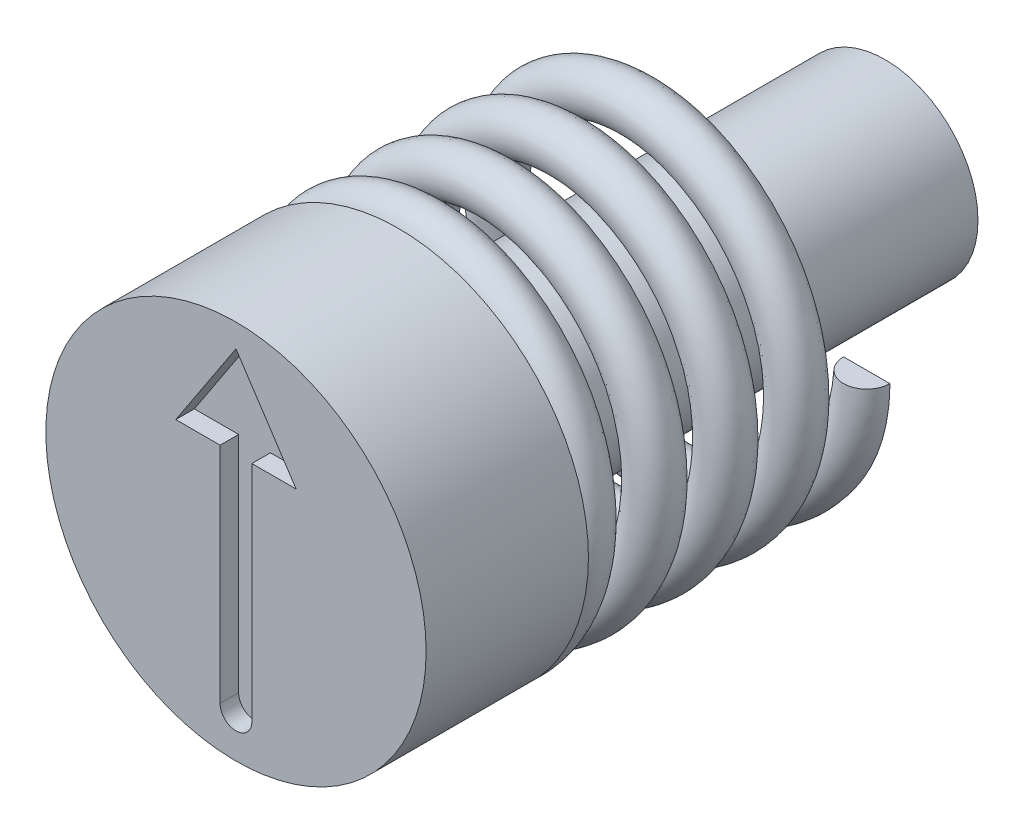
ISO-10303-21;
HEADER;
FILE_DESCRIPTION(('STEP AP214'),'2;1');
FILE_NAME('part.step','',(''),(''),'','','');
FILE_SCHEMA(('AUTOMOTIVE_DESIGN { 1 0 10303 214 1 1 1 1 }'));
ENDSEC;
DATA;
#1=APPLICATION_CONTEXT('core data for automotive mechanical design processes');
#2=APPLICATION_PROTOCOL_DEFINITION('international standard','automotive_design',2000,#1);
#3=PRODUCT_CONTEXT('',#1,'mechanical');
#4=PRODUCT('Part','Part','',(#3));
#5=PRODUCT_RELATED_PRODUCT_CATEGORY('part','',(#4));
#6=PRODUCT_DEFINITION_FORMATION('','',#4);
#7=PRODUCT_DEFINITION_CONTEXT('part definition',#1,'design');
#8=PRODUCT_DEFINITION('design','',#6,#7);
#9=PRODUCT_DEFINITION_SHAPE('','',#8);
#10=(LENGTH_UNIT() NAMED_UNIT(*) SI_UNIT(.MILLI.,.METRE.));
#11=(NAMED_UNIT(*) PLANE_ANGLE_UNIT() SI_UNIT($,.RADIAN.));
#12=(NAMED_UNIT(*) SI_UNIT($,.STERADIAN.) SOLID_ANGLE_UNIT());
#13=UNCERTAINTY_MEASURE_WITH_UNIT(LENGTH_MEASURE(1.E-05),#10,'distance_accuracy_value','');
#14=(GEOMETRIC_REPRESENTATION_CONTEXT(3) GLOBAL_UNCERTAINTY_ASSIGNED_CONTEXT((#13)) GLOBAL_UNIT_ASSIGNED_CONTEXT((#10,
#11,#12)) REPRESENTATION_CONTEXT('',''));
#15=CARTESIAN_POINT('',(0.,0.,0.));
#16=DIRECTION('',(0.,0.,1.));
#17=DIRECTION('',(1.,0.,0.));
#18=AXIS2_PLACEMENT_3D('',#15,#16,#17);
#19=CARTESIAN_POINT('',(3.6,0.,-10.5));
#20=DIRECTION('',(0.,-1.,0.));
#21=DIRECTION('',(0.,0.,-1.));
#22=AXIS2_PLACEMENT_3D('',#19,#20,#21);
#23=PLANE('',#22);
#24=CARTESIAN_POINT('',(3.6,0.,-10.));
#25=DIRECTION('',(0.,1.,0.));
#26=DIRECTION('',(0.,0.,1.));
#27=AXIS2_PLACEMENT_3D('',#24,#25,#26);
#28=CIRCLE('',#27,0.5);
#29=CARTESIAN_POINT('',(3.1,0.,-10.));
#30=VERTEX_POINT('',#29);
#31=CARTESIAN_POINT('',(4.1,0.,-10.));
#32=VERTEX_POINT('',#31);
#33=EDGE_CURVE('E88',#30,#32,#28,.T.);
#34=ORIENTED_EDGE('',*,*,#33,.T.);
#35=DIRECTION('',(-1.,0.,0.));
#36=VECTOR('',#35,1.);
#37=CARTESIAN_POINT('',(3.6,0.,-10.));
#38=LINE('',#37,#36);
#39=EDGE_CURVE('E75',#32,#30,#38,.T.);
#40=ORIENTED_EDGE('',*,*,#39,.T.);
#41=EDGE_LOOP('',(#34,#40));
#42=FACE_BOUND('',#41,.T.);
#43=ADVANCED_FACE('F49',(#42),#23,.F.);
#44=CARTESIAN_POINT('',(0.,-3.6,-4.));
#45=DIRECTION('',(-1.,0.,0.));
#46=DIRECTION('',(0.,-1.,0.));
#47=AXIS2_PLACEMENT_3D('',#44,#45,#46);
#48=PLANE('',#47);
#49=DIRECTION('',(0.,-1.,0.));
#50=VECTOR('',#49,1.);
#51=CARTESIAN_POINT('',(0.,-3.6,-3.5));
#52=LINE('',#51,#50);
#53=CARTESIAN_POINT('',(0.,-3.1,-3.5));
#54=VERTEX_POINT('',#53);
#55=CARTESIAN_POINT('',(0.,-4.1,-3.5));
#56=VERTEX_POINT('',#55);
#57=EDGE_CURVE('E69',#54,#56,#52,.T.);
#58=ORIENTED_EDGE('',*,*,#57,.F.);
#59=CARTESIAN_POINT('',(0.,-3.6,-3.5));
#60=DIRECTION('',(-1.,0.,0.));
#61=DIRECTION('',(0.,-1.,0.));
#62=AXIS2_PLACEMENT_3D('',#59,#60,#61);
#63=CIRCLE('',#62,0.5);
#64=EDGE_CURVE('E85',#54,#56,#63,.T.);
#65=ORIENTED_EDGE('',*,*,#64,.T.);
#66=EDGE_LOOP('',(#58,#65));
#67=FACE_BOUND('',#66,.T.);
#68=ADVANCED_FACE('F51',(#67),#48,.T.);
#69=CARTESIAN_POINT('',(3.6,0.,-9.5));
#70=CARTESIAN_POINT('',(3.6,-1.49116882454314,-9.40441176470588));
#71=CARTESIAN_POINT('',(2.54558441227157,-2.54558441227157,-9.30882352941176));
#72=CARTESIAN_POINT('',(1.49116882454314,-3.6,-9.21323529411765));
#73=CARTESIAN_POINT('',(0.,-3.6,-9.11764705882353));
#74=CARTESIAN_POINT('',(-1.49116882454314,-3.6,-9.02205882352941));
#75=CARTESIAN_POINT('',(-2.54558441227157,-2.54558441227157,-8.9264705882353));
#76=CARTESIAN_POINT('',(-3.6,-1.49116882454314,-8.83088235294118));
#77=CARTESIAN_POINT('',(-3.6,0.,-8.73529411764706));
#78=CARTESIAN_POINT('',(-3.6,1.49116882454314,-8.63970588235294));
#79=CARTESIAN_POINT('',(-2.54558441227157,2.54558441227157,-8.54411764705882));
#80=CARTESIAN_POINT('',(-1.49116882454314,3.6,-8.44852941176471));
#81=CARTESIAN_POINT('',(0.,3.6,-8.35294117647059));
#82=CARTESIAN_POINT('',(1.49116882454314,3.6,-8.25735294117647));
#83=CARTESIAN_POINT('',(2.54558441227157,2.54558441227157,-8.16176470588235));
#84=CARTESIAN_POINT('',(3.6,1.49116882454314,-8.06617647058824));
#85=CARTESIAN_POINT('',(3.6,0.,-7.97058823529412));
#86=CARTESIAN_POINT('',(3.6,-1.49116882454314,-7.875));
#87=CARTESIAN_POINT('',(2.54558441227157,-2.54558441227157,-7.77941176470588));
#88=CARTESIAN_POINT('',(1.49116882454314,-3.6,-7.68382352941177));
#89=CARTESIAN_POINT('',(0.,-3.6,-7.58823529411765));
#90=CARTESIAN_POINT('',(-1.49116882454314,-3.6,-7.49264705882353));
#91=CARTESIAN_POINT('',(-2.54558441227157,-2.54558441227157,-7.39705882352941));
#92=CARTESIAN_POINT('',(-3.6,-1.49116882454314,-7.3014705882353));
#93=CARTESIAN_POINT('',(-3.6,0.,-7.20588235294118));
#94=CARTESIAN_POINT('',(-3.6,1.49116882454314,-7.11029411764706));
#95=CARTESIAN_POINT('',(-2.54558441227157,2.54558441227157,-7.01470588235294));
#96=CARTESIAN_POINT('',(-1.49116882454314,3.6,-6.91911764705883));
#97=CARTESIAN_POINT('',(0.,3.6,-6.82352941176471));
#98=CARTESIAN_POINT('',(1.49116882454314,3.6,-6.72794117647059));
#99=CARTESIAN_POINT('',(2.54558441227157,2.54558441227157,-6.63235294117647));
#100=CARTESIAN_POINT('',(3.6,1.49116882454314,-6.53676470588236));
#101=CARTESIAN_POINT('',(3.6,0.,-6.44117647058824));
#102=CARTESIAN_POINT('',(3.6,-1.49116882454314,-6.34558823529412));
#103=CARTESIAN_POINT('',(2.54558441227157,-2.54558441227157,-6.25));
#104=CARTESIAN_POINT('',(1.49116882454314,-3.6,-6.15441176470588));
#105=CARTESIAN_POINT('',(0.,-3.6,-6.05882352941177));
#106=CARTESIAN_POINT('',(-1.49116882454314,-3.6,-5.96323529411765));
#107=CARTESIAN_POINT('',(-2.54558441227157,-2.54558441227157,-5.86764705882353));
#108=CARTESIAN_POINT('',(-3.6,-1.49116882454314,-5.77205882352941));
#109=CARTESIAN_POINT('',(-3.6,0.,-5.6764705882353));
#110=CARTESIAN_POINT('',(-3.6,1.49116882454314,-5.58088235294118));
#111=CARTESIAN_POINT('',(-2.54558441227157,2.54558441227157,-5.48529411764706));
#112=CARTESIAN_POINT('',(-1.49116882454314,3.6,-5.38970588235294));
#113=CARTESIAN_POINT('',(0.,3.6,-5.29411764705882));
#114=CARTESIAN_POINT('',(1.49116882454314,3.6,-5.19852941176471));
#115=CARTESIAN_POINT('',(2.54558441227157,2.54558441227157,-5.10294117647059));
#116=CARTESIAN_POINT('',(3.6,1.49116882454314,-5.00735294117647));
#117=CARTESIAN_POINT('',(3.6,0.,-4.91176470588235));
#118=CARTESIAN_POINT('',(3.6,-1.49116882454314,-4.81617647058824));
#119=CARTESIAN_POINT('',(2.54558441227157,-2.54558441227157,-4.72058823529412));
#120=CARTESIAN_POINT('',(1.49116882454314,-3.6,-4.625));
#121=CARTESIAN_POINT('',(0.,-3.6,-4.52941176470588));
#122=CARTESIAN_POINT('',(-1.49116882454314,-3.6,-4.43382352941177));
#123=CARTESIAN_POINT('',(-2.54558441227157,-2.54558441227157,-4.33823529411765));
#124=CARTESIAN_POINT('',(-3.6,-1.49116882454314,-4.24264705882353));
#125=CARTESIAN_POINT('',(-3.6,0.,-4.14705882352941));
#126=CARTESIAN_POINT('',(-3.6,1.49116882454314,-4.0514705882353));
#127=CARTESIAN_POINT('',(-2.54558441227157,2.54558441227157,-3.95588235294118));
#128=CARTESIAN_POINT('',(-1.49116882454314,3.6,-3.86029411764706));
#129=CARTESIAN_POINT('',(0.,3.6,-3.76470588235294));
#130=CARTESIAN_POINT('',(1.49116882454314,3.6,-3.66911764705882));
#131=CARTESIAN_POINT('',(2.54558441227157,2.54558441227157,-3.57352941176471));
#132=CARTESIAN_POINT('',(3.6,1.49116882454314,-3.47794117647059));
#133=CARTESIAN_POINT('',(3.6,0.,-3.38235294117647));
#134=CARTESIAN_POINT('',(3.6,-1.49116882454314,-3.28676470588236));
#135=CARTESIAN_POINT('',(2.54558441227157,-2.54558441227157,-3.19117647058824));
#136=CARTESIAN_POINT('',(1.49116882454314,-3.6,-3.09558823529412));
#137=CARTESIAN_POINT('',(0.,-3.6,-3.));
#138=CARTESIAN_POINT('',(4.6,0.,-9.5));
#139=CARTESIAN_POINT('',(4.6,-1.90538238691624,-9.40441176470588));
#140=CARTESIAN_POINT('',(3.25269119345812,-3.25269119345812,-9.30882352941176));
#141=CARTESIAN_POINT('',(1.90538238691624,-4.6,-9.21323529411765));
#142=CARTESIAN_POINT('',(0.,-4.6,-9.11764705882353));
#143=CARTESIAN_POINT('',(-1.90538238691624,-4.6,-9.02205882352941));
#144=CARTESIAN_POINT('',(-3.25269119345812,-3.25269119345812,-8.9264705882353));
#145=CARTESIAN_POINT('',(-4.6,-1.90538238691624,-8.83088235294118));
#146=CARTESIAN_POINT('',(-4.6,0.,-8.73529411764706));
#147=CARTESIAN_POINT('',(-4.6,1.90538238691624,-8.63970588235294));
#148=CARTESIAN_POINT('',(-3.25269119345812,3.25269119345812,-8.54411764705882));
#149=CARTESIAN_POINT('',(-1.90538238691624,4.6,-8.4485294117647));
#150=CARTESIAN_POINT('',(0.,4.6,-8.35294117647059));
#151=CARTESIAN_POINT('',(1.90538238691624,4.6,-8.25735294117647));
#152=CARTESIAN_POINT('',(3.25269119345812,3.25269119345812,-8.16176470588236));
#153=CARTESIAN_POINT('',(4.6,1.90538238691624,-8.06617647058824));
#154=CARTESIAN_POINT('',(4.6,0.,-7.97058823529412));
#155=CARTESIAN_POINT('',(4.6,-1.90538238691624,-7.875));
#156=CARTESIAN_POINT('',(3.25269119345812,-3.25269119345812,-7.77941176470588));
#157=CARTESIAN_POINT('',(1.90538238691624,-4.6,-7.68382352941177));
#158=CARTESIAN_POINT('',(0.,-4.6,-7.58823529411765));
#159=CARTESIAN_POINT('',(-1.90538238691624,-4.6,-7.49264705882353));
#160=CARTESIAN_POINT('',(-3.25269119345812,-3.25269119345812,-7.39705882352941));
#161=CARTESIAN_POINT('',(-4.6,-1.90538238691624,-7.30147058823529));
#162=CARTESIAN_POINT('',(-4.6,0.,-7.20588235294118));
#163=CARTESIAN_POINT('',(-4.6,1.90538238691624,-7.11029411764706));
#164=CARTESIAN_POINT('',(-3.25269119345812,3.25269119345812,-7.01470588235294));
#165=CARTESIAN_POINT('',(-1.90538238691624,4.6,-6.91911764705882));
#166=CARTESIAN_POINT('',(0.,4.6,-6.82352941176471));
#167=CARTESIAN_POINT('',(1.90538238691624,4.6,-6.72794117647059));
#168=CARTESIAN_POINT('',(3.25269119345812,3.25269119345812,-6.63235294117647));
#169=CARTESIAN_POINT('',(4.6,1.90538238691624,-6.53676470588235));
#170=CARTESIAN_POINT('',(4.6,0.,-6.44117647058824));
#171=CARTESIAN_POINT('',(4.6,-1.90538238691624,-6.34558823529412));
#172=CARTESIAN_POINT('',(3.25269119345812,-3.25269119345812,-6.25));
#173=CARTESIAN_POINT('',(1.90538238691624,-4.6,-6.15441176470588));
#174=CARTESIAN_POINT('',(0.,-4.6,-6.05882352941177));
#175=CARTESIAN_POINT('',(-1.90538238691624,-4.6,-5.96323529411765));
#176=CARTESIAN_POINT('',(-3.25269119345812,-3.25269119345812,-5.86764705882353));
#177=CARTESIAN_POINT('',(-4.6,-1.90538238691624,-5.77205882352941));
#178=CARTESIAN_POINT('',(-4.6,0.,-5.6764705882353));
#179=CARTESIAN_POINT('',(-4.6,1.90538238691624,-5.58088235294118));
#180=CARTESIAN_POINT('',(-3.25269119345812,3.25269119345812,-5.48529411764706));
#181=CARTESIAN_POINT('',(-1.90538238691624,4.6,-5.38970588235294));
#182=CARTESIAN_POINT('',(0.,4.6,-5.29411764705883));
#183=CARTESIAN_POINT('',(1.90538238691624,4.6,-5.19852941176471));
#184=CARTESIAN_POINT('',(3.25269119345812,3.25269119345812,-5.10294117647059));
#185=CARTESIAN_POINT('',(4.6,1.90538238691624,-5.00735294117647));
#186=CARTESIAN_POINT('',(4.6,0.,-4.91176470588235));
#187=CARTESIAN_POINT('',(4.6,-1.90538238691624,-4.81617647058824));
#188=CARTESIAN_POINT('',(3.25269119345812,-3.25269119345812,-4.72058823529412));
#189=CARTESIAN_POINT('',(1.90538238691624,-4.6,-4.625));
#190=CARTESIAN_POINT('',(0.,-4.6,-4.52941176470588));
#191=CARTESIAN_POINT('',(-1.90538238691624,-4.6,-4.43382352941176));
#192=CARTESIAN_POINT('',(-3.25269119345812,-3.25269119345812,-4.33823529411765));
#193=CARTESIAN_POINT('',(-4.6,-1.90538238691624,-4.24264705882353));
#194=CARTESIAN_POINT('',(-4.6,0.,-4.14705882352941));
#195=CARTESIAN_POINT('',(-4.6,1.90538238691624,-4.05147058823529));
#196=CARTESIAN_POINT('',(-3.25269119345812,3.25269119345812,-3.95588235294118));
#197=CARTESIAN_POINT('',(-1.90538238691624,4.6,-3.86029411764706));
#198=CARTESIAN_POINT('',(0.,4.6,-3.76470588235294));
#199=CARTESIAN_POINT('',(1.90538238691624,4.6,-3.66911764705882));
#200=CARTESIAN_POINT('',(3.25269119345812,3.25269119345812,-3.57352941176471));
#201=CARTESIAN_POINT('',(4.6,1.90538238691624,-3.47794117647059));
#202=CARTESIAN_POINT('',(4.6,0.,-3.38235294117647));
#203=CARTESIAN_POINT('',(4.6,-1.90538238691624,-3.28676470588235));
#204=CARTESIAN_POINT('',(3.25269119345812,-3.25269119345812,-3.19117647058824));
#205=CARTESIAN_POINT('',(1.90538238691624,-4.6,-3.09558823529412));
#206=CARTESIAN_POINT('',(0.,-4.6,-3.));
#207=CARTESIAN_POINT('',(4.6,0.,-10.5));
#208=CARTESIAN_POINT('',(4.6,-1.90538238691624,-10.4044117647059));
#209=CARTESIAN_POINT('',(3.25269119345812,-3.25269119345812,-10.3088235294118));
#210=CARTESIAN_POINT('',(1.90538238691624,-4.6,-10.2132352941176));
#211=CARTESIAN_POINT('',(0.,-4.6,-10.1176470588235));
#212=CARTESIAN_POINT('',(-1.90538238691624,-4.6,-10.0220588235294));
#213=CARTESIAN_POINT('',(-3.25269119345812,-3.25269119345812,-9.9264705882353));
#214=CARTESIAN_POINT('',(-4.6,-1.90538238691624,-9.83088235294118));
#215=CARTESIAN_POINT('',(-4.6,0.,-9.73529411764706));
#216=CARTESIAN_POINT('',(-4.6,1.90538238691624,-9.63970588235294));
#217=CARTESIAN_POINT('',(-3.25269119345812,3.25269119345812,-9.54411764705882));
#218=CARTESIAN_POINT('',(-1.90538238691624,4.6,-9.44852941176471));
#219=CARTESIAN_POINT('',(0.,4.6,-9.35294117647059));
#220=CARTESIAN_POINT('',(1.90538238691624,4.6,-9.25735294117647));
#221=CARTESIAN_POINT('',(3.25269119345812,3.25269119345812,-9.16176470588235));
#222=CARTESIAN_POINT('',(4.6,1.90538238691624,-9.06617647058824));
#223=CARTESIAN_POINT('',(4.6,0.,-8.97058823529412));
#224=CARTESIAN_POINT('',(4.6,-1.90538238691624,-8.875));
#225=CARTESIAN_POINT('',(3.25269119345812,-3.25269119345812,-8.77941176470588));
#226=CARTESIAN_POINT('',(1.90538238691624,-4.6,-8.68382352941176));
#227=CARTESIAN_POINT('',(0.,-4.6,-8.58823529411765));
#228=CARTESIAN_POINT('',(-1.90538238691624,-4.6,-8.49264705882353));
#229=CARTESIAN_POINT('',(-3.25269119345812,-3.25269119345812,-8.39705882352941));
#230=CARTESIAN_POINT('',(-4.6,-1.90538238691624,-8.30147058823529));
#231=CARTESIAN_POINT('',(-4.6,0.,-8.20588235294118));
#232=CARTESIAN_POINT('',(-4.6,1.90538238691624,-8.11029411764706));
#233=CARTESIAN_POINT('',(-3.25269119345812,3.25269119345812,-8.01470588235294));
#234=CARTESIAN_POINT('',(-1.90538238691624,4.6,-7.91911764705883));
#235=CARTESIAN_POINT('',(0.,4.6,-7.82352941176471));
#236=CARTESIAN_POINT('',(1.90538238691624,4.6,-7.72794117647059));
#237=CARTESIAN_POINT('',(3.25269119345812,3.25269119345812,-7.63235294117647));
#238=CARTESIAN_POINT('',(4.6,1.90538238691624,-7.53676470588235));
#239=CARTESIAN_POINT('',(4.6,0.,-7.44117647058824));
#240=CARTESIAN_POINT('',(4.6,-1.90538238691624,-7.34558823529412));
#241=CARTESIAN_POINT('',(3.25269119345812,-3.25269119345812,-7.25));
#242=CARTESIAN_POINT('',(1.90538238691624,-4.6,-7.15441176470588));
#243=CARTESIAN_POINT('',(0.,-4.6,-7.05882352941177));
#244=CARTESIAN_POINT('',(-1.90538238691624,-4.6,-6.96323529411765));
#245=CARTESIAN_POINT('',(-3.25269119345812,-3.25269119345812,-6.86764705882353));
#246=CARTESIAN_POINT('',(-4.6,-1.90538238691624,-6.77205882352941));
#247=CARTESIAN_POINT('',(-4.6,0.,-6.6764705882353));
#248=CARTESIAN_POINT('',(-4.6,1.90538238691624,-6.58088235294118));
#249=CARTESIAN_POINT('',(-3.25269119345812,3.25269119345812,-6.48529411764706));
#250=CARTESIAN_POINT('',(-1.90538238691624,4.6,-6.38970588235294));
#251=CARTESIAN_POINT('',(0.,4.6,-6.29411764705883));
#252=CARTESIAN_POINT('',(1.90538238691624,4.6,-6.19852941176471));
#253=CARTESIAN_POINT('',(3.25269119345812,3.25269119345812,-6.10294117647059));
#254=CARTESIAN_POINT('',(4.6,1.90538238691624,-6.00735294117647));
#255=CARTESIAN_POINT('',(4.6,0.,-5.91176470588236));
#256=CARTESIAN_POINT('',(4.6,-1.90538238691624,-5.81617647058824));
#257=CARTESIAN_POINT('',(3.25269119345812,-3.25269119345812,-5.72058823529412));
#258=CARTESIAN_POINT('',(1.90538238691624,-4.6,-5.625));
#259=CARTESIAN_POINT('',(0.,-4.6,-5.52941176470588));
#260=CARTESIAN_POINT('',(-1.90538238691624,-4.6,-5.43382352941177));
#261=CARTESIAN_POINT('',(-3.25269119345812,-3.25269119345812,-5.33823529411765));
#262=CARTESIAN_POINT('',(-4.6,-1.90538238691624,-5.24264705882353));
#263=CARTESIAN_POINT('',(-4.6,0.,-5.14705882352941));
#264=CARTESIAN_POINT('',(-4.6,1.90538238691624,-5.0514705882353));
#265=CARTESIAN_POINT('',(-3.25269119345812,3.25269119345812,-4.95588235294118));
#266=CARTESIAN_POINT('',(-1.90538238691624,4.6,-4.86029411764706));
#267=CARTESIAN_POINT('',(0.,4.6,-4.76470588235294));
#268=CARTESIAN_POINT('',(1.90538238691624,4.6,-4.66911764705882));
#269=CARTESIAN_POINT('',(3.25269119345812,3.25269119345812,-4.57352941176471));
#270=CARTESIAN_POINT('',(4.6,1.90538238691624,-4.47794117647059));
#271=CARTESIAN_POINT('',(4.6,0.,-4.38235294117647));
#272=CARTESIAN_POINT('',(4.6,-1.90538238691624,-4.28676470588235));
#273=CARTESIAN_POINT('',(3.25269119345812,-3.25269119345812,-4.19117647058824));
#274=CARTESIAN_POINT('',(1.90538238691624,-4.6,-4.09558823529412));
#275=CARTESIAN_POINT('',(0.,-4.6,-4.));
#276=CARTESIAN_POINT('',(3.6,0.,-10.5));
#277=CARTESIAN_POINT('',(3.6,-1.49116882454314,-10.4044117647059));
#278=CARTESIAN_POINT('',(2.54558441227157,-2.54558441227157,-10.3088235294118));
#279=CARTESIAN_POINT('',(1.49116882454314,-3.6,-10.2132352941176));
#280=CARTESIAN_POINT('',(0.,-3.6,-10.1176470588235));
#281=CARTESIAN_POINT('',(-1.49116882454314,-3.6,-10.0220588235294));
#282=CARTESIAN_POINT('',(-2.54558441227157,-2.54558441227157,-9.9264705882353));
#283=CARTESIAN_POINT('',(-3.6,-1.49116882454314,-9.83088235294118));
#284=CARTESIAN_POINT('',(-3.6,0.,-9.73529411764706));
#285=CARTESIAN_POINT('',(-3.6,1.49116882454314,-9.63970588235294));
#286=CARTESIAN_POINT('',(-2.54558441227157,2.54558441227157,-9.54411764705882));
#287=CARTESIAN_POINT('',(-1.49116882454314,3.6,-9.44852941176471));
#288=CARTESIAN_POINT('',(0.,3.6,-9.35294117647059));
#289=CARTESIAN_POINT('',(1.49116882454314,3.6,-9.25735294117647));
#290=CARTESIAN_POINT('',(2.54558441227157,2.54558441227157,-9.16176470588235));
#291=CARTESIAN_POINT('',(3.6,1.49116882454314,-9.06617647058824));
#292=CARTESIAN_POINT('',(3.6,0.,-8.97058823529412));
#293=CARTESIAN_POINT('',(3.6,-1.49116882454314,-8.875));
#294=CARTESIAN_POINT('',(2.54558441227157,-2.54558441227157,-8.77941176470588));
#295=CARTESIAN_POINT('',(1.49116882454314,-3.6,-8.68382352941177));
#296=CARTESIAN_POINT('',(0.,-3.6,-8.58823529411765));
#297=CARTESIAN_POINT('',(-1.49116882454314,-3.6,-8.49264705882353));
#298=CARTESIAN_POINT('',(-2.54558441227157,-2.54558441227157,-8.39705882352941));
#299=CARTESIAN_POINT('',(-3.6,-1.49116882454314,-8.3014705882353));
#300=CARTESIAN_POINT('',(-3.6,0.,-8.20588235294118));
#301=CARTESIAN_POINT('',(-3.6,1.49116882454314,-8.11029411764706));
#302=CARTESIAN_POINT('',(-2.54558441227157,2.54558441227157,-8.01470588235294));
#303=CARTESIAN_POINT('',(-1.49116882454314,3.6,-7.91911764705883));
#304=CARTESIAN_POINT('',(0.,3.6,-7.82352941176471));
#305=CARTESIAN_POINT('',(1.49116882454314,3.6,-7.72794117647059));
#306=CARTESIAN_POINT('',(2.54558441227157,2.54558441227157,-7.63235294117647));
#307=CARTESIAN_POINT('',(3.6,1.49116882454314,-7.53676470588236));
#308=CARTESIAN_POINT('',(3.6,0.,-7.44117647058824));
#309=CARTESIAN_POINT('',(3.6,-1.49116882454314,-7.34558823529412));
#310=CARTESIAN_POINT('',(2.54558441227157,-2.54558441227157,-7.25));
#311=CARTESIAN_POINT('',(1.49116882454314,-3.6,-7.15441176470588));
#312=CARTESIAN_POINT('',(0.,-3.6,-7.05882352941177));
#313=CARTESIAN_POINT('',(-1.49116882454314,-3.6,-6.96323529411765));
#314=CARTESIAN_POINT('',(-2.54558441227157,-2.54558441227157,-6.86764705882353));
#315=CARTESIAN_POINT('',(-3.6,-1.49116882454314,-6.77205882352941));
#316=CARTESIAN_POINT('',(-3.6,0.,-6.6764705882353));
#317=CARTESIAN_POINT('',(-3.6,1.49116882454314,-6.58088235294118));
#318=CARTESIAN_POINT('',(-2.54558441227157,2.54558441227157,-6.48529411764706));
#319=CARTESIAN_POINT('',(-1.49116882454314,3.6,-6.38970588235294));
#320=CARTESIAN_POINT('',(0.,3.6,-6.29411764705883));
#321=CARTESIAN_POINT('',(1.49116882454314,3.6,-6.19852941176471));
#322=CARTESIAN_POINT('',(2.54558441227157,2.54558441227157,-6.10294117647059));
#323=CARTESIAN_POINT('',(3.6,1.49116882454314,-6.00735294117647));
#324=CARTESIAN_POINT('',(3.6,0.,-5.91176470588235));
#325=CARTESIAN_POINT('',(3.6,-1.49116882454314,-5.81617647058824));
#326=CARTESIAN_POINT('',(2.54558441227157,-2.54558441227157,-5.72058823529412));
#327=CARTESIAN_POINT('',(1.49116882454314,-3.6,-5.625));
#328=CARTESIAN_POINT('',(0.,-3.6,-5.52941176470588));
#329=CARTESIAN_POINT('',(-1.49116882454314,-3.6,-5.43382352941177));
#330=CARTESIAN_POINT('',(-2.54558441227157,-2.54558441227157,-5.33823529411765));
#331=CARTESIAN_POINT('',(-3.6,-1.49116882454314,-5.24264705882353));
#332=CARTESIAN_POINT('',(-3.6,0.,-5.14705882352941));
#333=CARTESIAN_POINT('',(-3.6,1.49116882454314,-5.0514705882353));
#334=CARTESIAN_POINT('',(-2.54558441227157,2.54558441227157,-4.95588235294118));
#335=CARTESIAN_POINT('',(-1.49116882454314,3.6,-4.86029411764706));
#336=CARTESIAN_POINT('',(0.,3.6,-4.76470588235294));
#337=CARTESIAN_POINT('',(1.49116882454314,3.6,-4.66911764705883));
#338=CARTESIAN_POINT('',(2.54558441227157,2.54558441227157,-4.57352941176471));
#339=CARTESIAN_POINT('',(3.6,1.49116882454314,-4.47794117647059));
#340=CARTESIAN_POINT('',(3.6,0.,-4.38235294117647));
#341=CARTESIAN_POINT('',(3.6,-1.49116882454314,-4.28676470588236));
#342=CARTESIAN_POINT('',(2.54558441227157,-2.54558441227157,-4.19117647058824));
#343=CARTESIAN_POINT('',(1.49116882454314,-3.6,-4.09558823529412));
#344=CARTESIAN_POINT('',(0.,-3.6,-4.));
#345=CARTESIAN_POINT('',(2.6,0.,-10.5));
#346=CARTESIAN_POINT('',(2.6,-1.07695526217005,-10.4044117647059));
#347=CARTESIAN_POINT('',(1.83847763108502,-1.83847763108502,-10.3088235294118));
#348=CARTESIAN_POINT('',(1.07695526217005,-2.6,-10.2132352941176));
#349=CARTESIAN_POINT('',(0.,-2.6,-10.1176470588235));
#350=CARTESIAN_POINT('',(-1.07695526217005,-2.6,-10.0220588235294));
#351=CARTESIAN_POINT('',(-1.83847763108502,-1.83847763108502,-9.9264705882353));
#352=CARTESIAN_POINT('',(-2.6,-1.07695526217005,-9.83088235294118));
#353=CARTESIAN_POINT('',(-2.6,0.,-9.73529411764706));
#354=CARTESIAN_POINT('',(-2.6,1.07695526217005,-9.63970588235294));
#355=CARTESIAN_POINT('',(-1.83847763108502,1.83847763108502,-9.54411764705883));
#356=CARTESIAN_POINT('',(-1.07695526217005,2.6,-9.44852941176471));
#357=CARTESIAN_POINT('',(0.,2.6,-9.35294117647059));
#358=CARTESIAN_POINT('',(1.07695526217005,2.6,-9.25735294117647));
#359=CARTESIAN_POINT('',(1.83847763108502,1.83847763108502,-9.16176470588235));
#360=CARTESIAN_POINT('',(2.6,1.07695526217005,-9.06617647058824));
#361=CARTESIAN_POINT('',(2.6,0.,-8.97058823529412));
#362=CARTESIAN_POINT('',(2.6,-1.07695526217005,-8.875));
#363=CARTESIAN_POINT('',(1.83847763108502,-1.83847763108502,-8.77941176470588));
#364=CARTESIAN_POINT('',(1.07695526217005,-2.6,-8.68382352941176));
#365=CARTESIAN_POINT('',(0.,-2.6,-8.58823529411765));
#366=CARTESIAN_POINT('',(-1.07695526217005,-2.6,-8.49264705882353));
#367=CARTESIAN_POINT('',(-1.83847763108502,-1.83847763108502,-8.39705882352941));
#368=CARTESIAN_POINT('',(-2.6,-1.07695526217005,-8.30147058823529));
#369=CARTESIAN_POINT('',(-2.6,0.,-8.20588235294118));
#370=CARTESIAN_POINT('',(-2.6,1.07695526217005,-8.11029411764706));
#371=CARTESIAN_POINT('',(-1.83847763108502,1.83847763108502,-8.01470588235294));
#372=CARTESIAN_POINT('',(-1.07695526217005,2.6,-7.91911764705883));
#373=CARTESIAN_POINT('',(0.,2.6,-7.82352941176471));
#374=CARTESIAN_POINT('',(1.07695526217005,2.6,-7.72794117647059));
#375=CARTESIAN_POINT('',(1.83847763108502,1.83847763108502,-7.63235294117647));
#376=CARTESIAN_POINT('',(2.6,1.07695526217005,-7.53676470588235));
#377=CARTESIAN_POINT('',(2.6,0.,-7.44117647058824));
#378=CARTESIAN_POINT('',(2.6,-1.07695526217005,-7.34558823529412));
#379=CARTESIAN_POINT('',(1.83847763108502,-1.83847763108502,-7.25));
#380=CARTESIAN_POINT('',(1.07695526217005,-2.6,-7.15441176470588));
#381=CARTESIAN_POINT('',(0.,-2.6,-7.05882352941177));
#382=CARTESIAN_POINT('',(-1.07695526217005,-2.6,-6.96323529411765));
#383=CARTESIAN_POINT('',(-1.83847763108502,-1.83847763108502,-6.86764705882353));
#384=CARTESIAN_POINT('',(-2.6,-1.07695526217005,-6.77205882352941));
#385=CARTESIAN_POINT('',(-2.6,0.,-6.6764705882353));
#386=CARTESIAN_POINT('',(-2.6,1.07695526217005,-6.58088235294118));
#387=CARTESIAN_POINT('',(-1.83847763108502,1.83847763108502,-6.48529411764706));
#388=CARTESIAN_POINT('',(-1.07695526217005,2.6,-6.38970588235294));
#389=CARTESIAN_POINT('',(0.,2.6,-6.29411764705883));
#390=CARTESIAN_POINT('',(1.07695526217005,2.6,-6.19852941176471));
#391=CARTESIAN_POINT('',(1.83847763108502,1.83847763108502,-6.10294117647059));
#392=CARTESIAN_POINT('',(2.6,1.07695526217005,-6.00735294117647));
#393=CARTESIAN_POINT('',(2.6,0.,-5.91176470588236));
#394=CARTESIAN_POINT('',(2.6,-1.07695526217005,-5.81617647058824));
#395=CARTESIAN_POINT('',(1.83847763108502,-1.83847763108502,-5.72058823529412));
#396=CARTESIAN_POINT('',(1.07695526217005,-2.6,-5.625));
#397=CARTESIAN_POINT('',(0.,-2.6,-5.52941176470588));
#398=CARTESIAN_POINT('',(-1.07695526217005,-2.6,-5.43382352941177));
#399=CARTESIAN_POINT('',(-1.83847763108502,-1.83847763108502,-5.33823529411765));
#400=CARTESIAN_POINT('',(-2.6,-1.07695526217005,-5.24264705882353));
#401=CARTESIAN_POINT('',(-2.6,0.,-5.14705882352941));
#402=CARTESIAN_POINT('',(-2.6,1.07695526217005,-5.0514705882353));
#403=CARTESIAN_POINT('',(-1.83847763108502,1.83847763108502,-4.95588235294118));
#404=CARTESIAN_POINT('',(-1.07695526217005,2.6,-4.86029411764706));
#405=CARTESIAN_POINT('',(0.,2.6,-4.76470588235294));
#406=CARTESIAN_POINT('',(1.07695526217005,2.6,-4.66911764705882));
#407=CARTESIAN_POINT('',(1.83847763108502,1.83847763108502,-4.57352941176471));
#408=CARTESIAN_POINT('',(2.6,1.07695526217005,-4.47794117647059));
#409=CARTESIAN_POINT('',(2.6,0.,-4.38235294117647));
#410=CARTESIAN_POINT('',(2.6,-1.07695526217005,-4.28676470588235));
#411=CARTESIAN_POINT('',(1.83847763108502,-1.83847763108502,-4.19117647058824));
#412=CARTESIAN_POINT('',(1.07695526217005,-2.6,-4.09558823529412));
#413=CARTESIAN_POINT('',(0.,-2.6,-4.));
#414=CARTESIAN_POINT('',(2.6,0.,-9.5));
#415=CARTESIAN_POINT('',(2.6,-1.07695526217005,-9.40441176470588));
#416=CARTESIAN_POINT('',(1.83847763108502,-1.83847763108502,-9.30882352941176));
#417=CARTESIAN_POINT('',(1.07695526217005,-2.6,-9.21323529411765));
#418=CARTESIAN_POINT('',(0.,-2.6,-9.11764705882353));
#419=CARTESIAN_POINT('',(-1.07695526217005,-2.6,-9.02205882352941));
#420=CARTESIAN_POINT('',(-1.83847763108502,-1.83847763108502,-8.9264705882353));
#421=CARTESIAN_POINT('',(-2.6,-1.07695526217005,-8.83088235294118));
#422=CARTESIAN_POINT('',(-2.6,0.,-8.73529411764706));
#423=CARTESIAN_POINT('',(-2.6,1.07695526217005,-8.63970588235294));
#424=CARTESIAN_POINT('',(-1.83847763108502,1.83847763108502,-8.54411764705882));
#425=CARTESIAN_POINT('',(-1.07695526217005,2.6,-8.4485294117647));
#426=CARTESIAN_POINT('',(0.,2.6,-8.35294117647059));
#427=CARTESIAN_POINT('',(1.07695526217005,2.6,-8.25735294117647));
#428=CARTESIAN_POINT('',(1.83847763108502,1.83847763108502,-8.16176470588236));
#429=CARTESIAN_POINT('',(2.6,1.07695526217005,-8.06617647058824));
#430=CARTESIAN_POINT('',(2.6,0.,-7.97058823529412));
#431=CARTESIAN_POINT('',(2.6,-1.07695526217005,-7.875));
#432=CARTESIAN_POINT('',(1.83847763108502,-1.83847763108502,-7.77941176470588));
#433=CARTESIAN_POINT('',(1.07695526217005,-2.6,-7.68382352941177));
#434=CARTESIAN_POINT('',(0.,-2.6,-7.58823529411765));
#435=CARTESIAN_POINT('',(-1.07695526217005,-2.6,-7.49264705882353));
#436=CARTESIAN_POINT('',(-1.83847763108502,-1.83847763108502,-7.39705882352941));
#437=CARTESIAN_POINT('',(-2.6,-1.07695526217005,-7.30147058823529));
#438=CARTESIAN_POINT('',(-2.6,0.,-7.20588235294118));
#439=CARTESIAN_POINT('',(-2.6,1.07695526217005,-7.11029411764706));
#440=CARTESIAN_POINT('',(-1.83847763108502,1.83847763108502,-7.01470588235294));
#441=CARTESIAN_POINT('',(-1.07695526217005,2.6,-6.91911764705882));
#442=CARTESIAN_POINT('',(0.,2.6,-6.82352941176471));
#443=CARTESIAN_POINT('',(1.07695526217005,2.6,-6.72794117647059));
#444=CARTESIAN_POINT('',(1.83847763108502,1.83847763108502,-6.63235294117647));
#445=CARTESIAN_POINT('',(2.6,1.07695526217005,-6.53676470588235));
#446=CARTESIAN_POINT('',(2.6,0.,-6.44117647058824));
#447=CARTESIAN_POINT('',(2.6,-1.07695526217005,-6.34558823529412));
#448=CARTESIAN_POINT('',(1.83847763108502,-1.83847763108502,-6.25));
#449=CARTESIAN_POINT('',(1.07695526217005,-2.6,-6.15441176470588));
#450=CARTESIAN_POINT('',(0.,-2.6,-6.05882352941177));
#451=CARTESIAN_POINT('',(-1.07695526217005,-2.6,-5.96323529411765));
#452=CARTESIAN_POINT('',(-1.83847763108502,-1.83847763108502,-5.86764705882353));
#453=CARTESIAN_POINT('',(-2.6,-1.07695526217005,-5.77205882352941));
#454=CARTESIAN_POINT('',(-2.6,0.,-5.6764705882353));
#455=CARTESIAN_POINT('',(-2.6,1.07695526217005,-5.58088235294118));
#456=CARTESIAN_POINT('',(-1.83847763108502,1.83847763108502,-5.48529411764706));
#457=CARTESIAN_POINT('',(-1.07695526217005,2.6,-5.38970588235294));
#458=CARTESIAN_POINT('',(0.,2.6,-5.29411764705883));
#459=CARTESIAN_POINT('',(1.07695526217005,2.6,-5.19852941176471));
#460=CARTESIAN_POINT('',(1.83847763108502,1.83847763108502,-5.10294117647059));
#461=CARTESIAN_POINT('',(2.6,1.07695526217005,-5.00735294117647));
#462=CARTESIAN_POINT('',(2.6,0.,-4.91176470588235));
#463=CARTESIAN_POINT('',(2.6,-1.07695526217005,-4.81617647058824));
#464=CARTESIAN_POINT('',(1.83847763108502,-1.83847763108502,-4.72058823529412));
#465=CARTESIAN_POINT('',(1.07695526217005,-2.6,-4.625));
#466=CARTESIAN_POINT('',(0.,-2.6,-4.52941176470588));
#467=CARTESIAN_POINT('',(-1.07695526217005,-2.6,-4.43382352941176));
#468=CARTESIAN_POINT('',(-1.83847763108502,-1.83847763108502,-4.33823529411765));
#469=CARTESIAN_POINT('',(-2.6,-1.07695526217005,-4.24264705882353));
#470=CARTESIAN_POINT('',(-2.6,0.,-4.14705882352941));
#471=CARTESIAN_POINT('',(-2.6,1.07695526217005,-4.05147058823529));
#472=CARTESIAN_POINT('',(-1.83847763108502,1.83847763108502,-3.95588235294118));
#473=CARTESIAN_POINT('',(-1.07695526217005,2.6,-3.86029411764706));
#474=CARTESIAN_POINT('',(0.,2.6,-3.76470588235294));
#475=CARTESIAN_POINT('',(1.07695526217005,2.6,-3.66911764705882));
#476=CARTESIAN_POINT('',(1.83847763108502,1.83847763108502,-3.57352941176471));
#477=CARTESIAN_POINT('',(2.6,1.07695526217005,-3.47794117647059));
#478=CARTESIAN_POINT('',(2.6,0.,-3.38235294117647));
#479=CARTESIAN_POINT('',(2.6,-1.07695526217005,-3.28676470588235));
#480=CARTESIAN_POINT('',(1.83847763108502,-1.83847763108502,-3.19117647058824));
#481=CARTESIAN_POINT('',(1.07695526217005,-2.6,-3.09558823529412));
#482=CARTESIAN_POINT('',(0.,-2.6,-3.));
#483=CARTESIAN_POINT('',(3.6,0.,-9.5));
#484=CARTESIAN_POINT('',(3.6,-1.49116882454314,-9.40441176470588));
#485=CARTESIAN_POINT('',(2.54558441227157,-2.54558441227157,-9.30882352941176));
#486=CARTESIAN_POINT('',(1.49116882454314,-3.6,-9.21323529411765));
#487=CARTESIAN_POINT('',(0.,-3.6,-9.11764705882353));
#488=CARTESIAN_POINT('',(-1.49116882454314,-3.6,-9.02205882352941));
#489=CARTESIAN_POINT('',(-2.54558441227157,-2.54558441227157,-8.9264705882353));
#490=CARTESIAN_POINT('',(-3.6,-1.49116882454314,-8.83088235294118));
#491=CARTESIAN_POINT('',(-3.6,0.,-8.73529411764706));
#492=CARTESIAN_POINT('',(-3.6,1.49116882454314,-8.63970588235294));
#493=CARTESIAN_POINT('',(-2.54558441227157,2.54558441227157,-8.54411764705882));
#494=CARTESIAN_POINT('',(-1.49116882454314,3.6,-8.44852941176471));
#495=CARTESIAN_POINT('',(0.,3.6,-8.35294117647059));
#496=CARTESIAN_POINT('',(1.49116882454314,3.6,-8.25735294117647));
#497=CARTESIAN_POINT('',(2.54558441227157,2.54558441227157,-8.16176470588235));
#498=CARTESIAN_POINT('',(3.6,1.49116882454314,-8.06617647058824));
#499=CARTESIAN_POINT('',(3.6,0.,-7.97058823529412));
#500=CARTESIAN_POINT('',(3.6,-1.49116882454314,-7.875));
#501=CARTESIAN_POINT('',(2.54558441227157,-2.54558441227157,-7.77941176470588));
#502=CARTESIAN_POINT('',(1.49116882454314,-3.6,-7.68382352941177));
#503=CARTESIAN_POINT('',(0.,-3.6,-7.58823529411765));
#504=CARTESIAN_POINT('',(-1.49116882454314,-3.6,-7.49264705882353));
#505=CARTESIAN_POINT('',(-2.54558441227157,-2.54558441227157,-7.39705882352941));
#506=CARTESIAN_POINT('',(-3.6,-1.49116882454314,-7.3014705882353));
#507=CARTESIAN_POINT('',(-3.6,0.,-7.20588235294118));
#508=CARTESIAN_POINT('',(-3.6,1.49116882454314,-7.11029411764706));
#509=CARTESIAN_POINT('',(-2.54558441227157,2.54558441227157,-7.01470588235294));
#510=CARTESIAN_POINT('',(-1.49116882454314,3.6,-6.91911764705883));
#511=CARTESIAN_POINT('',(0.,3.6,-6.82352941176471));
#512=CARTESIAN_POINT('',(1.49116882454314,3.6,-6.72794117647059));
#513=CARTESIAN_POINT('',(2.54558441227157,2.54558441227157,-6.63235294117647));
#514=CARTESIAN_POINT('',(3.6,1.49116882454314,-6.53676470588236));
#515=CARTESIAN_POINT('',(3.6,0.,-6.44117647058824));
#516=CARTESIAN_POINT('',(3.6,-1.49116882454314,-6.34558823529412));
#517=CARTESIAN_POINT('',(2.54558441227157,-2.54558441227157,-6.25));
#518=CARTESIAN_POINT('',(1.49116882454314,-3.6,-6.15441176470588));
#519=CARTESIAN_POINT('',(0.,-3.6,-6.05882352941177));
#520=CARTESIAN_POINT('',(-1.49116882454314,-3.6,-5.96323529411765));
#521=CARTESIAN_POINT('',(-2.54558441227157,-2.54558441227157,-5.86764705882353));
#522=CARTESIAN_POINT('',(-3.6,-1.49116882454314,-5.77205882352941));
#523=CARTESIAN_POINT('',(-3.6,0.,-5.6764705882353));
#524=CARTESIAN_POINT('',(-3.6,1.49116882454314,-5.58088235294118));
#525=CARTESIAN_POINT('',(-2.54558441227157,2.54558441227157,-5.48529411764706));
#526=CARTESIAN_POINT('',(-1.49116882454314,3.6,-5.38970588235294));
#527=CARTESIAN_POINT('',(0.,3.6,-5.29411764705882));
#528=CARTESIAN_POINT('',(1.49116882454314,3.6,-5.19852941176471));
#529=CARTESIAN_POINT('',(2.54558441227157,2.54558441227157,-5.10294117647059));
#530=CARTESIAN_POINT('',(3.6,1.49116882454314,-5.00735294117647));
#531=CARTESIAN_POINT('',(3.6,0.,-4.91176470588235));
#532=CARTESIAN_POINT('',(3.6,-1.49116882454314,-4.81617647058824));
#533=CARTESIAN_POINT('',(2.54558441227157,-2.54558441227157,-4.72058823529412));
#534=CARTESIAN_POINT('',(1.49116882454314,-3.6,-4.625));
#535=CARTESIAN_POINT('',(0.,-3.6,-4.52941176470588));
#536=CARTESIAN_POINT('',(-1.49116882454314,-3.6,-4.43382352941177));
#537=CARTESIAN_POINT('',(-2.54558441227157,-2.54558441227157,-4.33823529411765));
#538=CARTESIAN_POINT('',(-3.6,-1.49116882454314,-4.24264705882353));
#539=CARTESIAN_POINT('',(-3.6,0.,-4.14705882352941));
#540=CARTESIAN_POINT('',(-3.6,1.49116882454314,-4.0514705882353));
#541=CARTESIAN_POINT('',(-2.54558441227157,2.54558441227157,-3.95588235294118));
#542=CARTESIAN_POINT('',(-1.49116882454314,3.6,-3.86029411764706));
#543=CARTESIAN_POINT('',(0.,3.6,-3.76470588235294));
#544=CARTESIAN_POINT('',(1.49116882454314,3.6,-3.66911764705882));
#545=CARTESIAN_POINT('',(2.54558441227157,2.54558441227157,-3.57352941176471));
#546=CARTESIAN_POINT('',(3.6,1.49116882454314,-3.47794117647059));
#547=CARTESIAN_POINT('',(3.6,0.,-3.38235294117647));
#548=CARTESIAN_POINT('',(3.6,-1.49116882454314,-3.28676470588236));
#549=CARTESIAN_POINT('',(2.54558441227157,-2.54558441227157,-3.19117647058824));
#550=CARTESIAN_POINT('',(1.49116882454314,-3.6,-3.09558823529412));
#551=CARTESIAN_POINT('',(0.,-3.6,-3.));
#552=(BOUNDED_SURFACE() B_SPLINE_SURFACE(3,2,((#69,#70,#71,#72,#73,#74,#75,#76,#77,#78,#79,#80,
#81,#82,#83,#84,#85,#86,#87,#88,#89,#90,#91,#92,#93,#94,#95,#96,#97,#98,#99,#100,#101,#102,#103,
#104,#105,#106,#107,#108,#109,#110,#111,#112,#113,#114,#115,#116,#117,#118,#119,#120,#121,#122,
#123,#124,#125,#126,#127,#128,#129,#130,#131,#132,#133,#134,#135,#136,#137),(#138,#139,#140,
#141,#142,#143,#144,#145,#146,#147,#148,#149,#150,#151,#152,#153,#154,#155,#156,#157,#158,#159,
#160,#161,#162,#163,#164,#165,#166,#167,#168,#169,#170,#171,#172,#173,#174,#175,#176,#177,#178,
#179,#180,#181,#182,#183,#184,#185,#186,#187,#188,#189,#190,#191,#192,#193,#194,#195,#196,#197,
#198,#199,#200,#201,#202,#203,#204,#205,#206),(#207,#208,#209,#210,#211,#212,#213,#214,#215,
#216,#217,#218,#219,#220,#221,#222,#223,#224,#225,#226,#227,#228,#229,#230,#231,#232,#233,#234,
#235,#236,#237,#238,#239,#240,#241,#242,#243,#244,#245,#246,#247,#248,#249,#250,#251,#252,#253,
#254,#255,#256,#257,#258,#259,#260,#261,#262,#263,#264,#265,#266,#267,#268,#269,#270,#271,#272,
#273,#274,#275),(#276,#277,#278,#279,#280,#281,#282,#283,#284,#285,#286,#287,#288,#289,#290,
#291,#292,#293,#294,#295,#296,#297,#298,#299,#300,#301,#302,#303,#304,#305,#306,#307,#308,#309,
#310,#311,#312,#313,#314,#315,#316,#317,#318,#319,#320,#321,#322,#323,#324,#325,#326,#327,#328,
#329,#330,#331,#332,#333,#334,#335,#336,#337,#338,#339,#340,#341,#342,#343,#344),(#345,#346,
#347,#348,#349,#350,#351,#352,#353,#354,#355,#356,#357,#358,#359,#360,#361,#362,#363,#364,#365,
#366,#367,#368,#369,#370,#371,#372,#373,#374,#375,#376,#377,#378,#379,#380,#381,#382,#383,#384,
#385,#386,#387,#388,#389,#390,#391,#392,#393,#394,#395,#396,#397,#398,#399,#400,#401,#402,#403,
#404,#405,#406,#407,#408,#409,#410,#411,#412,#413),(#414,#415,#416,#417,#418,#419,#420,#421,
#422,#423,#424,#425,#426,#427,#428,#429,#430,#431,#432,#433,#434,#435,#436,#437,#438,#439,#440,
#441,#442,#443,#444,#445,#446,#447,#448,#449,#450,#451,#452,#453,#454,#455,#456,#457,#458,#459,
#460,#461,#462,#463,#464,#465,#466,#467,#468,#469,#470,#471,#472,#473,#474,#475,#476,#477,#478,
#479,#480,#481,#482),(#483,#484,#485,#486,#487,#488,#489,#490,#491,#492,#493,#494,#495,#496,
#497,#498,#499,#500,#501,#502,#503,#504,#505,#506,#507,#508,#509,#510,#511,#512,#513,#514,#515,
#516,#517,#518,#519,#520,#521,#522,#523,#524,#525,#526,#527,#528,#529,#530,#531,#532,#533,#534,
#535,#536,#537,#538,#539,#540,#541,#542,#543,#544,#545,#546,#547,#548,#549,#550,#551)),
.UNSPECIFIED.,.T.,.F.,.F.) B_SPLINE_SURFACE_WITH_KNOTS((4,3,4),(3,2,2,2,2,2,2,2,2,2,2,2,2,2,2,2,
2,2,2,2,2,2,2,2,2,2,2,2,2,2,2,2,2,2,3),(0.,0.5,1.),(0.,0.025,0.05,0.075,0.1,0.125,0.15,0.175,
0.2,0.225,0.25,0.275,0.3,0.325,0.35,0.375,0.4,0.425,0.45,0.475,0.5,0.525,0.55,0.575,0.6,0.625,
0.65,0.675,0.7,0.725,0.75,0.775,0.8,0.825,0.85),
.UNSPECIFIED.) GEOMETRIC_REPRESENTATION_ITEM() RATIONAL_B_SPLINE_SURFACE(((1.,0.923879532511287,
1.,0.923879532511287,1.,0.923879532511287,1.,0.923879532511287,1.,0.923879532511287,1.,
0.923879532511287,1.,0.923879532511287,1.,0.923879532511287,1.,0.923879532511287,1.,
0.923879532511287,1.,0.923879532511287,1.,0.923879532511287,1.,0.923879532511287,1.,
0.923879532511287,1.,0.923879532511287,1.,0.923879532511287,1.,0.923879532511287,1.,
0.923879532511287,1.,0.923879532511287,1.,0.923879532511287,1.,0.923879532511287,1.,
0.923879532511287,1.,0.923879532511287,1.,0.923879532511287,1.,0.923879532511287,1.,
0.923879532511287,1.,0.923879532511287,1.,0.923879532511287,1.,0.923879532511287,1.,
0.923879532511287,1.,0.923879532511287,1.,0.923879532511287,1.,0.923879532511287,1.,
0.923879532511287,1.),(0.333333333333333,0.307959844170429,0.333333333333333,0.307959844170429,
0.333333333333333,0.307959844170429,0.333333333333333,0.307959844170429,0.333333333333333,
0.307959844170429,0.333333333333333,0.307959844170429,0.333333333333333,0.307959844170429,
0.333333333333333,0.307959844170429,0.333333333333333,0.307959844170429,0.333333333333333,
0.307959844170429,0.333333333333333,0.307959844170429,0.333333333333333,0.307959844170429,
0.333333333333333,0.307959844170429,0.333333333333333,0.307959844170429,0.333333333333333,
0.307959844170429,0.333333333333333,0.307959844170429,0.333333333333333,0.307959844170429,
0.333333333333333,0.307959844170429,0.333333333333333,0.307959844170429,0.333333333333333,
0.307959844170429,0.333333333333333,0.307959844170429,0.333333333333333,0.307959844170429,
0.333333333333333,0.307959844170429,0.333333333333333,0.307959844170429,0.333333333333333,
0.307959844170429,0.333333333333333,0.307959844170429,0.333333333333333,0.307959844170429,
0.333333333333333,0.307959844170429,0.333333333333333,0.307959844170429,0.333333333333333,
0.307959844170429,0.333333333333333,0.307959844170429,0.333333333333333,0.307959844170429,
0.333333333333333,0.307959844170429,0.333333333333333,0.307959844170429,0.333333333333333),
(0.333333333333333,0.307959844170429,0.333333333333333,0.307959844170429,0.333333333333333,
0.307959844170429,0.333333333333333,0.307959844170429,0.333333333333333,0.307959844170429,
0.333333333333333,0.307959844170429,0.333333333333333,0.307959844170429,0.333333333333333,
0.307959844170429,0.333333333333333,0.307959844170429,0.333333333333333,0.307959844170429,
0.333333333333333,0.307959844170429,0.333333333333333,0.307959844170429,0.333333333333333,
0.307959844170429,0.333333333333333,0.307959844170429,0.333333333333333,0.307959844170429,
0.333333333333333,0.307959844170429,0.333333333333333,0.307959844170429,0.333333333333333,
0.307959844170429,0.333333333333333,0.307959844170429,0.333333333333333,0.307959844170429,
0.333333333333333,0.307959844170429,0.333333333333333,0.307959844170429,0.333333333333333,
0.307959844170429,0.333333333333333,0.307959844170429,0.333333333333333,0.307959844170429,
0.333333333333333,0.307959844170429,0.333333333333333,0.307959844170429,0.333333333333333,
0.307959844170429,0.333333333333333,0.307959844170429,0.333333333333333,0.307959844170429,
0.333333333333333,0.307959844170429,0.333333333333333,0.307959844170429,0.333333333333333,
0.307959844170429,0.333333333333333,0.307959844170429,0.333333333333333),(1.,0.923879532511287,
1.,0.923879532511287,1.,0.923879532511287,1.,0.923879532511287,1.,0.923879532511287,1.,
0.923879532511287,1.,0.923879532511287,1.,0.923879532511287,1.,0.923879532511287,1.,
0.923879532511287,1.,0.923879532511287,1.,0.923879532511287,1.,0.923879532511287,1.,
0.923879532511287,1.,0.923879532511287,1.,0.923879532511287,1.,0.923879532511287,1.,
0.923879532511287,1.,0.923879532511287,1.,0.923879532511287,1.,0.923879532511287,1.,
0.923879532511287,1.,0.923879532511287,1.,0.923879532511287,1.,0.923879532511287,1.,
0.923879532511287,1.,0.923879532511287,1.,0.923879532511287,1.,0.923879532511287,1.,
0.923879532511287,1.,0.923879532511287,1.,0.923879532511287,1.,0.923879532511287,1.,
0.923879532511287,1.),(0.333333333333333,0.307959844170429,0.333333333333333,0.307959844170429,
0.333333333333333,0.307959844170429,0.333333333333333,0.307959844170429,0.333333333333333,
0.307959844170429,0.333333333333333,0.307959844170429,0.333333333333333,0.307959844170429,
0.333333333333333,0.307959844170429,0.333333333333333,0.307959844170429,0.333333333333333,
0.307959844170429,0.333333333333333,0.307959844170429,0.333333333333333,0.307959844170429,
0.333333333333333,0.307959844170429,0.333333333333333,0.307959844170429,0.333333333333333,
0.307959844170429,0.333333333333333,0.307959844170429,0.333333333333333,0.307959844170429,
0.333333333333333,0.307959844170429,0.333333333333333,0.307959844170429,0.333333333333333,
0.307959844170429,0.333333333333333,0.307959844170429,0.333333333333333,0.307959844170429,
0.333333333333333,0.307959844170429,0.333333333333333,0.307959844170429,0.333333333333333,
0.307959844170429,0.333333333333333,0.307959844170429,0.333333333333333,0.307959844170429,
0.333333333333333,0.307959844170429,0.333333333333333,0.307959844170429,0.333333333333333,
0.307959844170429,0.333333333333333,0.307959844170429,0.333333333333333,0.307959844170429,
0.333333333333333,0.307959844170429,0.333333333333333,0.307959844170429,0.333333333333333),
(0.333333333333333,0.307959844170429,0.333333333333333,0.307959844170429,0.333333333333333,
0.307959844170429,0.333333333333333,0.307959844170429,0.333333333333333,0.307959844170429,
0.333333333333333,0.307959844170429,0.333333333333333,0.307959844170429,0.333333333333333,
0.307959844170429,0.333333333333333,0.307959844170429,0.333333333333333,0.307959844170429,
0.333333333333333,0.307959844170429,0.333333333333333,0.307959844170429,0.333333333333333,
0.307959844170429,0.333333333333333,0.307959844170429,0.333333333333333,0.307959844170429,
0.333333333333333,0.307959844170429,0.333333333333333,0.307959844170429,0.333333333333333,
0.307959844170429,0.333333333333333,0.307959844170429,0.333333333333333,0.307959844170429,
0.333333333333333,0.307959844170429,0.333333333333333,0.307959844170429,0.333333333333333,
0.307959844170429,0.333333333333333,0.307959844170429,0.333333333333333,0.307959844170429,
0.333333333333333,0.307959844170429,0.333333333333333,0.307959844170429,0.333333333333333,
0.307959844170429,0.333333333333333,0.307959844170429,0.333333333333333,0.307959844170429,
0.333333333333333,0.307959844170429,0.333333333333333,0.307959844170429,0.333333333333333,
0.307959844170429,0.333333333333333,0.307959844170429,0.333333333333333),(1.,0.923879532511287,
1.,0.923879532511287,1.,0.923879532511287,1.,0.923879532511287,1.,0.923879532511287,1.,
0.923879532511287,1.,0.923879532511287,1.,0.923879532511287,1.,0.923879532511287,1.,
0.923879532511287,1.,0.923879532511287,1.,0.923879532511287,1.,0.923879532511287,1.,
0.923879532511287,1.,0.923879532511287,1.,0.923879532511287,1.,0.923879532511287,1.,
0.923879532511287,1.,0.923879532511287,1.,0.923879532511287,1.,0.923879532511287,1.,
0.923879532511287,1.,0.923879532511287,1.,0.923879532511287,1.,0.923879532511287,1.,
0.923879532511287,1.,0.923879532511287,1.,0.923879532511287,1.,0.923879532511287,1.,
0.923879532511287,1.,0.923879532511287,1.,0.923879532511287,1.,0.923879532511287,1.,
0.923879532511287,1.))) REPRESENTATION_ITEM('') SURFACE());
#553=CARTESIAN_POINT('',(3.1,0.,-10.));
#554=CARTESIAN_POINT('',(3.09999879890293,-0.0843593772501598,-10.));
#555=CARTESIAN_POINT('',(3.09667302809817,-0.168681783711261,-10.));
#556=CARTESIAN_POINT('',(3.08342143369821,-0.336800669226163,-10.));
#557=CARTESIAN_POINT('',(3.0734960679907,-0.420597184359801,-10.));
#558=CARTESIAN_POINT('',(3.03392430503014,-0.670343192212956,-10.));
#559=CARTESIAN_POINT('',(2.99448199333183,-0.834848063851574,-10.));
#560=CARTESIAN_POINT('',(2.89055780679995,-1.15566278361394,-10.));
#561=CARTESIAN_POINT('',(2.82607348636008,-1.31197182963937,-10.));
#562=CARTESIAN_POINT('',(2.67361217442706,-1.61273937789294,-10.));
#563=CARTESIAN_POINT('',(2.58563987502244,-1.75720023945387,-10.));
#564=CARTESIAN_POINT('',(2.43371655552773,-1.96787154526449,-10.));
#565=CARTESIAN_POINT('',(2.37724731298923,-2.03958919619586,-10.));
#566=CARTESIAN_POINT('',(2.25844522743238,-2.1779954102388,-10.));
#567=CARTESIAN_POINT('',(2.19611186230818,-2.24468352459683,-10.));
#568=CARTESIAN_POINT('',(2.00114174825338,-2.43678352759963,-10.));
#569=CARTESIAN_POINT('',(1.86051631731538,-2.55425670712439,-10.));
#570=CARTESIAN_POINT('',(1.55968748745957,-2.76669246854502,-10.));
#571=CARTESIAN_POINT('',(1.39919000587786,-2.86123501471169,-10.));
#572=CARTESIAN_POINT('',(1.06500581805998,-3.0230866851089,-10.));
#573=CARTESIAN_POINT('',(0.89132498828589,-3.09040785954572,-10.));
#574=CARTESIAN_POINT('',(0.621354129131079,-3.17092969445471,-10.));
#575=CARTESIAN_POINT('',(0.528045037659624,-3.19458410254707,-10.));
#576=CARTESIAN_POINT('',(0.339781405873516,-3.23418416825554,-10.));
#577=CARTESIAN_POINT('',(0.244826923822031,-3.25013009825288,-9.99999999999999));
#578=CARTESIAN_POINT('',(0.0539834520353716,-3.27417196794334,-10.));
#579=CARTESIAN_POINT('',(-0.0419051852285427,-3.28227076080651,-10.));
#580=CARTESIAN_POINT('',(-0.234002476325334,-3.29146947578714,-9.99999999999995));
#581=CARTESIAN_POINT('',(-0.330211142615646,-3.29256912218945,-9.99999999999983));
#582=CARTESIAN_POINT('',(-0.528310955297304,-3.28802608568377,-9.9999999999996));
#583=CARTESIAN_POINT('',(-0.630192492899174,-3.28197002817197,-9.99999999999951));
#584=CARTESIAN_POINT('',(-0.782537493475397,-3.26804202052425,-10.0000000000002));
#585=CARTESIAN_POINT('',(-0.833241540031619,-3.26259172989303,-10.0000000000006));
#586=CARTESIAN_POINT('',(-0.934479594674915,-3.25028794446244,-9.99999999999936));
#587=CARTESIAN_POINT('',(-0.985013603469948,-3.24343445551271,-9.99999999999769));
#588=CARTESIAN_POINT('',(-1.08708770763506,-3.22845900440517,-9.99999999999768));
#589=CARTESIAN_POINT('',(-1.1386239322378,-3.22031129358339,-9.99999999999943));
#590=CARTESIAN_POINT('',(-1.21586598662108,-3.20770319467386,-10.0000000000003));
#591=CARTESIAN_POINT('',(-1.2416043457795,-3.2034358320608,-10.0000000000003));
#592=CARTESIAN_POINT('',(-1.29308408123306,-3.1949151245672,-9.99999999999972));
#593=CARTESIAN_POINT('',(-1.31882545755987,-3.19066177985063,-9.99999999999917));
#594=CARTESIAN_POINT('',(-1.36467492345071,-3.1833069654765,-9.99999999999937));
#595=CARTESIAN_POINT('',(-1.38477543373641,-3.18015807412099,-9.99999999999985));
#596=CARTESIAN_POINT('',(-1.42502395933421,-3.17418902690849,-10.0000000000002));
#597=CARTESIAN_POINT('',(-1.44517196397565,-3.17136880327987,-9.99999999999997));
#598=CARTESIAN_POINT('',(-1.48303208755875,-3.16670663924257,-10.));
#599=CARTESIAN_POINT('',(-1.50073476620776,-3.16478657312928,-10.0000000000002));
#600=CARTESIAN_POINT('',(-1.53626779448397,-3.16187633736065,-9.99999999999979));
#601=CARTESIAN_POINT('',(-1.55409829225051,-3.16088752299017,-9.99999999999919));
#602=CARTESIAN_POINT('',(-1.58089590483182,-3.16097715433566,-9.99999999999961));
#603=CARTESIAN_POINT('',(-1.58986214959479,-3.16127221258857,-9.99999999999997));
#604=CARTESIAN_POINT('',(-1.60770835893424,-3.16275456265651,-10.));
#605=CARTESIAN_POINT('',(-1.6165885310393,-3.16393761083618,-9.99999999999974));
#606=CARTESIAN_POINT('',(-1.63121172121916,-3.16732195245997,-9.99999999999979));
#607=CARTESIAN_POINT('',(-1.63705279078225,-3.16907870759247,-9.99999999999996));
#608=CARTESIAN_POINT('',(-1.6483076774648,-3.17396517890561,-10.));
#609=CARTESIAN_POINT('',(-1.65371766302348,-3.17710586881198,-9.99999999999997));
#610=CARTESIAN_POINT('',(-1.6612259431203,-3.18405421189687,-10.));
#611=CARTESIAN_POINT('',(-1.66382576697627,-3.18727955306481,-10.0000000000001));
#612=CARTESIAN_POINT('',(-1.66770594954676,-3.19445897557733,-9.99999999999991));
#613=CARTESIAN_POINT('',(-1.66898322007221,-3.198414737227,-9.99999999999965));
#614=CARTESIAN_POINT('',(-1.67046822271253,-3.20770505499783,-9.99999999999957));
#615=CARTESIAN_POINT('',(-1.67023732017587,-3.21309569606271,-9.99999999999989));
#616=CARTESIAN_POINT('',(-1.66862244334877,-3.22299601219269,-10.0000000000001));
#617=CARTESIAN_POINT('',(-1.66737336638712,-3.22753593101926,-10.));
#618=CARTESIAN_POINT('',(-1.66426831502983,-3.23641327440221,-9.99999999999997));
#619=CARTESIAN_POINT('',(-1.66241048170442,-3.24075003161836,-9.99999999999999));
#620=CARTESIAN_POINT('',(-1.6571683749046,-3.2515633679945,-10.));
#621=CARTESIAN_POINT('',(-1.65350721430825,-3.25790162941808,-10.));
#622=CARTESIAN_POINT('',(-1.64563465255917,-3.27020781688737,-10.));
#623=CARTESIAN_POINT('',(-1.6414235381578,-3.27617593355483,-10.));
#624=CARTESIAN_POINT('',(-1.62819148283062,-3.29372891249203,-10.));
#625=CARTESIAN_POINT('',(-1.6186131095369,-3.30489036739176,-10.));
#626=CARTESIAN_POINT('',(-1.59919549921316,-3.32586663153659,-10.));
#627=CARTESIAN_POINT('',(-1.58939794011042,-3.33572157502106,-10.));
#628=CARTESIAN_POINT('',(-1.56929799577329,-3.35490596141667,-10.));
#629=CARTESIAN_POINT('',(-1.55899549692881,-3.36423528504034,-10.));
#630=CARTESIAN_POINT('',(-1.52749924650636,-3.39161582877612,-10.));
#631=CARTESIAN_POINT('',(-1.50574996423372,-3.40902564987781,-10.));
#632=CARTESIAN_POINT('',(-1.46127319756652,-3.44255914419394,-10.));
#633=CARTESIAN_POINT('',(-1.43854503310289,-3.45868190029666,-10.));
#634=CARTESIAN_POINT('',(-1.39237505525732,-3.48981200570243,-10.));
#635=CARTESIAN_POINT('',(-1.3689339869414,-3.50482046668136,-10.));
#636=CARTESIAN_POINT('',(-1.28199331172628,-3.55803806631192,-10.));
#637=CARTESIAN_POINT('',(-1.21669503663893,-3.59332948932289,-10.));
#638=CARTESIAN_POINT('',(-1.08326886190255,-3.6582080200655,-10.));
#639=CARTESIAN_POINT('',(-1.01513699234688,-3.68778677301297,-10.));
#640=CARTESIAN_POINT('',(-0.876786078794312,-3.74161328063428,-10.));
#641=CARTESIAN_POINT('',(-0.806566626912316,-3.76585998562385,-10.));
#642=CARTESIAN_POINT('',(-0.664565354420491,-3.80925163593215,-10.));
#643=CARTESIAN_POINT('',(-0.592783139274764,-3.82839527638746,-10.));
#644=CARTESIAN_POINT('',(-0.424878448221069,-3.86705270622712,-10.));
#645=CARTESIAN_POINT('',(-0.328323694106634,-3.88472127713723,-10.));
#646=CARTESIAN_POINT('',(-0.182634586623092,-3.90489794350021,-10.));
#647=CARTESIAN_POINT('',(-0.133912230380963,-3.9105699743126,-10.));
#648=CARTESIAN_POINT('',(-0.0362641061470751,-3.91981291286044,-9.99999999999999));
#649=CARTESIAN_POINT('',(0.0126616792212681,-3.92338363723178,-9.99999999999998));
#650=CARTESIAN_POINT('',(0.159607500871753,-3.93114451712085,-10.));
#651=CARTESIAN_POINT('',(0.25779790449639,-3.93238363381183,-10.0000000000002));
#652=CARTESIAN_POINT('',(0.453936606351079,-3.92703449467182,-9.99999999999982));
#653=CARTESIAN_POINT('',(0.551884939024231,-3.92044742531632,-9.9999999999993));
#654=CARTESIAN_POINT('',(0.747955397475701,-3.89944554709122,-9.99999999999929));
#655=CARTESIAN_POINT('',(0.846069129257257,-3.88495168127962,-9.99999999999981));
#656=CARTESIAN_POINT('',(1.04081956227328,-3.84823825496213,-10.0000000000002));
#657=CARTESIAN_POINT('',(1.13745623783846,-3.82601856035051,-10.0000000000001));
#658=CARTESIAN_POINT('',(1.4241688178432,-3.74805602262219,-9.99999999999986));
#659=CARTESIAN_POINT('',(1.61127790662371,-3.68098457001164,-9.99999999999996));
#660=CARTESIAN_POINT('',(1.98510526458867,-3.51301574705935,-10.));
#661=CARTESIAN_POINT('',(2.17093245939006,-3.41012901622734,-10.));
#662=CARTESIAN_POINT('',(2.43501848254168,-3.23412238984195,-10.));
#663=CARTESIAN_POINT('',(2.52065563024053,-3.17179313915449,-10.));
#664=CARTESIAN_POINT('',(2.68655205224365,-3.04030612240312,-10.));
#665=CARTESIAN_POINT('',(2.76681123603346,-2.97114824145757,-10.));
#666=CARTESIAN_POINT('',(2.92314131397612,-2.82498562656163,-10.));
#667=CARTESIAN_POINT('',(2.9990826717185,-2.74784264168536,-10.));
#668=CARTESIAN_POINT('',(3.14442773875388,-2.58762217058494,-10.));
#669=CARTESIAN_POINT('',(3.21383128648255,-2.50454453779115,-10.));
#670=CARTESIAN_POINT('',(3.34561164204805,-2.33296691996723,-10.));
#671=CARTESIAN_POINT('',(3.40798720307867,-2.24446597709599,-10.));
#672=CARTESIAN_POINT('',(3.52528243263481,-2.0626583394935,-10.));
#673=CARTESIAN_POINT('',(3.5802022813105,-1.96935176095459,-9.99999999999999));
#674=CARTESIAN_POINT('',(3.68371963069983,-1.77574804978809,-9.99999999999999));
#675=CARTESIAN_POINT('',(3.73208378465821,-1.67532604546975,-10.));
#676=CARTESIAN_POINT('',(3.82018375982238,-1.47076551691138,-10.));
#677=CARTESIAN_POINT('',(3.85991947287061,-1.36662694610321,-10.));
#678=CARTESIAN_POINT('',(3.93046213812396,-1.15545755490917,-10.));
#679=CARTESIAN_POINT('',(3.96127588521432,-1.04842900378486,-10.));
#680=CARTESIAN_POINT('',(4.01380102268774,-0.832202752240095,-10.));
#681=CARTESIAN_POINT('',(4.03551588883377,-0.723005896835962,-10.));
#682=CARTESIAN_POINT('',(4.06840643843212,-0.511628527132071,-10.));
#683=CARTESIAN_POINT('',(4.08026356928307,-0.409553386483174,-10.));
#684=CARTESIAN_POINT('',(4.09605706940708,-0.204985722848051,-9.99999999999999));
#685=CARTESIAN_POINT('',(4.1000083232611,-0.102494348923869,-9.99999999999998));
#686=CARTESIAN_POINT('',(4.1,-5.4569984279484E-13,-9.99999999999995));
#687=B_SPLINE_CURVE_WITH_KNOTS('',3,(#553,#554,#555,#556,#557,#558,#559,#560,#561,#562,#563,
#564,#565,#566,#567,#568,#569,#570,#571,#572,#573,#574,#575,#576,#577,#578,#579,#580,#581,#582,
#583,#584,#585,#586,#587,#588,#589,#590,#591,#592,#593,#594,#595,#596,#597,#598,#599,#600,#601,
#602,#603,#604,#605,#606,#607,#608,#609,#610,#611,#612,#613,#614,#615,#616,#617,#618,#619,#620,
#621,#622,#623,#624,#625,#626,#627,#628,#629,#630,#631,#632,#633,#634,#635,#636,#637,#638,#639,
#640,#641,#642,#643,#644,#645,#646,#647,#648,#649,#650,#651,#652,#653,#654,#655,#656,#657,#658,
#659,#660,#661,#662,#663,#664,#665,#666,#667,#668,#669,#670,#671,#672,#673,#674,#675,#676,#677,
#678,#679,#680,#681,#682,#683,#684,#685,#686),.UNSPECIFIED.,.F.,.F.,(4,2,2,2,2,2,2,2,2,2,2,2,2,
2,2,2,2,2,2,2,2,2,2,2,2,2,2,2,2,2,2,2,2,2,2,2,2,2,2,2,2,2,2,2,2,2,2,2,2,2,2,2,2,2,2,2,2,2,2,2,2,
2,2,2,2,2,4),(0.,0.25294003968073,0.505862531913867,1.01111732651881,1.51642147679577,
2.02162476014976,2.29517629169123,2.56875220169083,3.11581006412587,3.67223816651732,
4.22841968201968,4.51693568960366,4.80544150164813,5.09384237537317,5.38225460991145,
5.68817613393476,5.84114860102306,5.99412043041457,6.15064263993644,6.22891219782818,
6.30718266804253,6.3682196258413,6.42924397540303,6.48266113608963,6.53615591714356,
6.56305366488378,6.58982368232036,6.60806418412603,6.62645199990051,6.63863744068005,
6.65085127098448,6.66674798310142,6.68082658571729,6.69494858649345,6.71685563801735,
6.73875131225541,6.78278962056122,6.82446141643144,6.8661426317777,6.94964710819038,
7.03321056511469,7.11668950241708,7.33897362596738,7.56158041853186,7.78423099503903,
8.00693844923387,8.300975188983,8.44809231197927,8.59522227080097,8.88947644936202,
9.18368602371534,9.48089268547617,9.77810450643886,10.3718400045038,11.0059335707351,
11.3233936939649,11.6408591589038,11.9652490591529,12.2896469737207,12.6141023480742,
12.9385498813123,13.2725361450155,13.6065265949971,13.9402620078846,14.2738698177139,
14.5818510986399,14.8892519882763),.UNSPECIFIED.);
#688=EDGE_CURVE('E63',#30,#32,#687,.T.);
#689=CARTESIAN_POINT('',(0.,-3.1,-3.5));
#690=CARTESIAN_POINT('',(0.0843593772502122,-3.09999879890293,-3.5));
#691=CARTESIAN_POINT('',(0.168681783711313,-3.09667302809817,-3.5));
#692=CARTESIAN_POINT('',(0.336800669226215,-3.08342143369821,-3.5));
#693=CARTESIAN_POINT('',(0.420597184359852,-3.07349606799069,-3.5));
#694=CARTESIAN_POINT('',(0.670343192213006,-3.03392430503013,-3.5));
#695=CARTESIAN_POINT('',(0.834848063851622,-2.99448199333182,-3.5));
#696=CARTESIAN_POINT('',(1.15566278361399,-2.89055780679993,-3.5));
#697=CARTESIAN_POINT('',(1.31197182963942,-2.82607348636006,-3.5));
#698=CARTESIAN_POINT('',(1.61273937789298,-2.67361217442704,-3.5));
#699=CARTESIAN_POINT('',(1.75720023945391,-2.58563987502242,-3.5));
#700=CARTESIAN_POINT('',(1.96787154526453,-2.4337165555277,-3.5));
#701=CARTESIAN_POINT('',(2.0395891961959,-2.3772473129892,-3.5));
#702=CARTESIAN_POINT('',(2.17799541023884,-2.25844522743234,-3.5));
#703=CARTESIAN_POINT('',(2.24468352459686,-2.19611186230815,-3.5));
#704=CARTESIAN_POINT('',(2.43678352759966,-2.00114174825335,-3.5));
#705=CARTESIAN_POINT('',(2.55425670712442,-1.86051631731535,-3.5));
#706=CARTESIAN_POINT('',(2.76669246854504,-1.55968748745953,-3.5));
#707=CARTESIAN_POINT('',(2.86123501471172,-1.39919000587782,-3.5));
#708=CARTESIAN_POINT('',(3.02308668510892,-1.06500581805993,-3.5));
#709=CARTESIAN_POINT('',(3.09040785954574,-0.891324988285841,-3.5));
#710=CARTESIAN_POINT('',(3.17092969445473,-0.621354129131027,-3.5));
#711=CARTESIAN_POINT('',(3.19458410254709,-0.528045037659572,-3.5));
#712=CARTESIAN_POINT('',(3.23418416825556,-0.339781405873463,-3.5));
#713=CARTESIAN_POINT('',(3.2501300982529,-0.244826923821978,-3.50000000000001));
#714=CARTESIAN_POINT('',(3.27417196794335,-0.0539834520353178,-3.49999999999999));
#715=CARTESIAN_POINT('',(3.28227076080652,0.0419051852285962,-3.49999999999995));
#716=CARTESIAN_POINT('',(3.29146947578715,0.234002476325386,-3.50000000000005));
#717=CARTESIAN_POINT('',(3.29256912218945,0.330211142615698,-3.50000000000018));
#718=CARTESIAN_POINT('',(3.28802608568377,0.528310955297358,-3.5000000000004));
#719=CARTESIAN_POINT('',(3.28197002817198,0.63019249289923,-3.50000000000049));
#720=CARTESIAN_POINT('',(3.26804202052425,0.782537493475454,-3.49999999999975));
#721=CARTESIAN_POINT('',(3.26259172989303,0.833241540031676,-3.49999999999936));
#722=CARTESIAN_POINT('',(3.25028794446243,0.934479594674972,-3.50000000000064));
#723=CARTESIAN_POINT('',(3.2434344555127,0.985013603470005,-3.50000000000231));
#724=CARTESIAN_POINT('',(3.22845900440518,1.08708770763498,-3.50000000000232));
#725=CARTESIAN_POINT('',(3.22031129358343,1.1386239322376,-3.50000000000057));
#726=CARTESIAN_POINT('',(3.20770319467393,1.21586598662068,-3.49999999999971));
#727=CARTESIAN_POINT('',(3.20343583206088,1.24160434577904,-3.49999999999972));
#728=CARTESIAN_POINT('',(3.1949151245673,1.29308408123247,-3.50000000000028));
#729=CARTESIAN_POINT('',(3.19066177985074,1.31882545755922,-3.50000000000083));
#730=CARTESIAN_POINT('',(3.18330696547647,1.36467492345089,-3.50000000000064));
#731=CARTESIAN_POINT('',(3.18015807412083,1.38477543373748,-3.50000000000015));
#732=CARTESIAN_POINT('',(3.17418902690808,1.42502395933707,-3.49999999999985));
#733=CARTESIAN_POINT('',(3.17136880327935,1.44517196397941,-3.50000000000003));
#734=CARTESIAN_POINT('',(3.16670663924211,1.48303208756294,-3.49999999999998));
#735=CARTESIAN_POINT('',(3.16478657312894,1.50073476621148,-3.49999999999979));
#736=CARTESIAN_POINT('',(3.16187633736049,1.53626779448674,-3.50000000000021));
#737=CARTESIAN_POINT('',(3.16088752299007,1.5540982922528,-3.50000000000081));
#738=CARTESIAN_POINT('',(3.16097715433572,1.58089590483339,-3.50000000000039));
#739=CARTESIAN_POINT('',(3.16127221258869,1.5898621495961,-3.50000000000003));
#740=CARTESIAN_POINT('',(3.16275456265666,1.60770835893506,-3.49999999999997));
#741=CARTESIAN_POINT('',(3.1639376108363,1.61658853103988,-3.50000000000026));
#742=CARTESIAN_POINT('',(3.16732195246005,1.63121172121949,-3.50000000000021));
#743=CARTESIAN_POINT('',(3.16907870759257,1.63705279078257,-3.50000000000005));
#744=CARTESIAN_POINT('',(3.17396517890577,1.64830767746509,-3.49999999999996));
#745=CARTESIAN_POINT('',(3.17710586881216,1.65371766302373,-3.50000000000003));
#746=CARTESIAN_POINT('',(3.1840542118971,1.6612259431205,-3.49999999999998));
#747=CARTESIAN_POINT('',(3.18727955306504,1.66382576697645,-3.49999999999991));
#748=CARTESIAN_POINT('',(3.19445897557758,1.66770594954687,-3.50000000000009));
#749=CARTESIAN_POINT('',(3.19841473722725,1.66898322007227,-3.50000000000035));
#750=CARTESIAN_POINT('',(3.20770505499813,1.67046822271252,-3.50000000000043));
#751=CARTESIAN_POINT('',(3.21309569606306,1.67023732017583,-3.50000000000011));
#752=CARTESIAN_POINT('',(3.22299601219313,1.66862244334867,-3.4999999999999));
#753=CARTESIAN_POINT('',(3.22753593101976,1.66737336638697,-3.49999999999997));
#754=CARTESIAN_POINT('',(3.23641327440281,1.6642683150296,-3.50000000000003));
#755=CARTESIAN_POINT('',(3.24075003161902,1.66241048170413,-3.50000000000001));
#756=CARTESIAN_POINT('',(3.25156336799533,1.65716837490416,-3.49999999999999));
#757=CARTESIAN_POINT('',(3.25790162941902,1.65350721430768,-3.5));
#758=CARTESIAN_POINT('',(3.27020781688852,1.64563465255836,-3.5));
#759=CARTESIAN_POINT('',(3.27617593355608,1.64142353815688,-3.5));
#760=CARTESIAN_POINT('',(3.29372891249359,1.62819148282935,-3.5));
#761=CARTESIAN_POINT('',(3.30489036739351,1.61861310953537,-3.5));
#762=CARTESIAN_POINT('',(3.32586663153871,1.59919549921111,-3.5));
#763=CARTESIAN_POINT('',(3.33572157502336,1.5893979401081,-3.5));
#764=CARTESIAN_POINT('',(3.35490596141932,1.56929799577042,-3.5));
#765=CARTESIAN_POINT('',(3.36423528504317,1.55899549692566,-3.5));
#766=CARTESIAN_POINT('',(3.39161582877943,1.52749924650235,-3.5));
#767=CARTESIAN_POINT('',(3.40902564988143,1.50574996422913,-3.5));
#768=CARTESIAN_POINT('',(3.44255914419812,1.46127319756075,-3.5));
#769=CARTESIAN_POINT('',(3.45868190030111,1.43854503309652,-3.5));
#770=CARTESIAN_POINT('',(3.48981200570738,1.39237505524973,-3.5));
#771=CARTESIAN_POINT('',(3.50482046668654,1.3689339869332,-3.5));
#772=CARTESIAN_POINT('',(3.5580380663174,1.28199331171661,-3.5));
#773=CARTESIAN_POINT('',(3.59332948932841,1.21669503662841,-3.5));
#774=CARTESIAN_POINT('',(3.65820802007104,1.08326886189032,-3.5));
#775=CARTESIAN_POINT('',(3.68778677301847,1.0151369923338,-3.5));
#776=CARTESIAN_POINT('',(3.74161328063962,0.876786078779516,-3.5));
#777=CARTESIAN_POINT('',(3.76585998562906,0.806566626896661,-3.5));
#778=CARTESIAN_POINT('',(3.80925163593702,0.664565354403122,-3.5));
#779=CARTESIAN_POINT('',(3.82839527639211,0.59278313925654,-3.5));
#780=CARTESIAN_POINT('',(3.867052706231,0.424878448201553,-3.5));
#781=CARTESIAN_POINT('',(3.88472127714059,0.328323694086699,-3.5));
#782=CARTESIAN_POINT('',(3.90489794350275,0.182634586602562,-3.5));
#783=CARTESIAN_POINT('',(3.91056997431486,0.133912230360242,-3.5));
#784=CARTESIAN_POINT('',(3.91981291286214,0.0362641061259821,-3.50000000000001));
#785=CARTESIAN_POINT('',(3.9233836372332,-0.012661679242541,-3.50000000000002));
#786=CARTESIAN_POINT('',(3.93114451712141,-0.159607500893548,-3.49999999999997));
#787=CARTESIAN_POINT('',(3.93238363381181,-0.25779790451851,-3.49999999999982));
#788=CARTESIAN_POINT('',(3.9270344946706,-0.453936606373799,-3.50000000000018));
#789=CARTESIAN_POINT('',(3.92044742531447,-0.551884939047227,-3.5000000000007));
#790=CARTESIAN_POINT('',(3.89944554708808,-0.747955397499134,-3.50000000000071));
#791=CARTESIAN_POINT('',(3.88495168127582,-0.846069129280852,-3.5000000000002));
#792=CARTESIAN_POINT('',(3.84823825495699,-1.04081956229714,-3.49999999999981));
#793=CARTESIAN_POINT('',(3.82601856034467,-1.13745623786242,-3.49999999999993));
#794=CARTESIAN_POINT('',(3.74805602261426,-1.42416881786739,-3.50000000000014));
#795=CARTESIAN_POINT('',(3.68098457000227,-1.61127790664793,-3.50000000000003));
#796=CARTESIAN_POINT('',(3.51301574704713,-1.98510526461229,-3.49999999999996));
#797=CARTESIAN_POINT('',(3.41012901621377,-2.17093245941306,-3.49999999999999));
#798=CARTESIAN_POINT('',(3.23412238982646,-2.43501848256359,-3.5));
#799=CARTESIAN_POINT('',(3.17179313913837,-2.52065563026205,-3.5));
#800=CARTESIAN_POINT('',(3.04030612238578,-2.68655205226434,-3.5));
#801=CARTESIAN_POINT('',(2.97114824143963,-2.76681123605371,-3.5));
#802=CARTESIAN_POINT('',(2.82498562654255,-2.92314131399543,-3.5));
#803=CARTESIAN_POINT('',(2.74784264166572,-2.99908267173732,-3.5));
#804=CARTESIAN_POINT('',(2.58762217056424,-3.14442773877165,-3.5));
#805=CARTESIAN_POINT('',(2.50454453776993,-3.21383128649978,-3.5));
#806=CARTESIAN_POINT('',(2.33296691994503,-3.34561164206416,-3.5));
#807=CARTESIAN_POINT('',(2.24446597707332,-3.40798720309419,-3.5));
#808=CARTESIAN_POINT('',(2.06265833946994,-3.52528243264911,-3.5));
#809=CARTESIAN_POINT('',(1.96935176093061,-3.58020228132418,-3.50000000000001));
#810=CARTESIAN_POINT('',(1.7757480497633,-3.68371963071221,-3.50000000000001));
#811=CARTESIAN_POINT('',(1.67532604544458,-3.7320837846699,-3.5));
#812=CARTESIAN_POINT('',(1.47076551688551,-3.82018375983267,-3.5));
#813=CARTESIAN_POINT('',(1.36662694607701,-3.85991947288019,-3.5));
#814=CARTESIAN_POINT('',(1.15545755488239,-3.93046213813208,-3.5));
#815=CARTESIAN_POINT('',(1.04842900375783,-3.9612758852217,-3.5));
#816=CARTESIAN_POINT('',(0.832202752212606,-4.01380102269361,-3.5));
#817=CARTESIAN_POINT('',(0.723005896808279,-4.03551588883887,-3.5));
#818=CARTESIAN_POINT('',(0.511628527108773,-4.06840643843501,-3.5));
#819=CARTESIAN_POINT('',(0.409553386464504,-4.08026356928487,-3.5));
#820=CARTESIAN_POINT('',(0.204985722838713,-4.09605706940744,-3.50000000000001));
#821=CARTESIAN_POINT('',(0.102494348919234,-4.1000083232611,-3.50000000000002));
#822=CARTESIAN_POINT('',(6.1341471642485E-13,-4.1,-3.50000000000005));
#823=B_SPLINE_CURVE_WITH_KNOTS('',3,(#689,#690,#691,#692,#693,#694,#695,#696,#697,#698,#699,
#700,#701,#702,#703,#704,#705,#706,#707,#708,#709,#710,#711,#712,#713,#714,#715,#716,#717,#718,
#719,#720,#721,#722,#723,#724,#725,#726,#727,#728,#729,#730,#731,#732,#733,#734,#735,#736,#737,
#738,#739,#740,#741,#742,#743,#744,#745,#746,#747,#748,#749,#750,#751,#752,#753,#754,#755,#756,
#757,#758,#759,#760,#761,#762,#763,#764,#765,#766,#767,#768,#769,#770,#771,#772,#773,#774,#775,
#776,#777,#778,#779,#780,#781,#782,#783,#784,#785,#786,#787,#788,#789,#790,#791,#792,#793,#794,
#795,#796,#797,#798,#799,#800,#801,#802,#803,#804,#805,#806,#807,#808,#809,#810,#811,#812,#813,
#814,#815,#816,#817,#818,#819,#820,#821,#822),.UNSPECIFIED.,.F.,.F.,(4,2,2,2,2,2,2,2,2,2,2,2,2,
2,2,2,2,2,2,2,2,2,2,2,2,2,2,2,2,2,2,2,2,2,2,2,2,2,2,2,2,2,2,2,2,2,2,2,2,2,2,2,2,2,2,2,2,2,2,2,2,
2,2,2,2,2,4),(0.,0.252940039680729,0.505862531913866,1.0111173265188,1.51642147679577,
2.02162476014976,2.29517629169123,2.56875220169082,3.11581006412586,3.67223816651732,
4.22841968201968,4.51693568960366,4.80544150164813,5.09384237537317,5.38225460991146,
5.68817613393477,5.84114860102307,5.99412043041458,6.15064263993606,6.2289121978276,
6.30718266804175,6.36821962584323,6.42924397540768,6.48266113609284,6.53615591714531,
6.5630536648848,6.58982368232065,6.6080641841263,6.62645199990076,6.63863744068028,
6.65085127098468,6.66674798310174,6.68082658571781,6.69494858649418,6.71685563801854,
6.73875131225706,6.78278962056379,6.82446141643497,6.86614263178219,6.9496471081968,
7.03321056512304,7.11668950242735,7.33897362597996,7.56158041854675,7.78423099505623,
8.00693844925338,8.30097518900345,8.4480923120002,8.59522227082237,8.88947644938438,
9.18368602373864,9.48089268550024,9.7781045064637,10.3718400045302,11.0059335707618,
11.3233936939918,11.6408591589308,11.9652490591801,12.289646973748,12.6141023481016,
12.9385498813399,13.2725361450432,13.606526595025,13.9402620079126,14.273869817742,
14.5818510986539,14.8892519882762),.UNSPECIFIED.);
#824=EDGE_CURVE('E12',#54,#56,#823,.T.);
#825=ORIENTED_EDGE('',*,*,#33,.F.);
#826=ORIENTED_EDGE('',*,*,#688,.T.);
#827=EDGE_LOOP('',(#825,#826));
#828=FACE_BOUND('',#827,.T.);
#829=ORIENTED_EDGE('',*,*,#64,.F.);
#830=ORIENTED_EDGE('',*,*,#824,.T.);
#831=EDGE_LOOP('',(#829,#830));
#832=FACE_BOUND('',#831,.T.);
#833=ADVANCED_FACE('F87',(#828,#832),#552,.F.);
#834=CARTESIAN_POINT('',(-4.88493412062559,-4.1,-10.));
#835=DIRECTION('',(0.,0.,1.));
#836=DIRECTION('',(1.,0.,0.));
#837=AXIS2_PLACEMENT_3D('',#834,#835,#836);
#838=PLANE('',#837);
#839=ORIENTED_EDGE('',*,*,#688,.F.);
#840=ORIENTED_EDGE('',*,*,#39,.F.);
#841=EDGE_LOOP('',(#839,#840));
#842=FACE_BOUND('',#841,.T.);
#843=ADVANCED_FACE('F101',(#842),#838,.F.);
#844=CARTESIAN_POINT('',(4.1,-4.1,-3.5));
#845=DIRECTION('',(0.,0.,-1.));
#846=DIRECTION('',(-1.,0.,0.));
#847=AXIS2_PLACEMENT_3D('',#844,#845,#846);
#848=PLANE('',#847);
#849=ORIENTED_EDGE('',*,*,#57,.T.);
#850=ORIENTED_EDGE('',*,*,#824,.F.);
#851=EDGE_LOOP('',(#849,#850));
#852=FACE_BOUND('',#851,.T.);
#853=ADVANCED_FACE('F80',(#852),#848,.F.);
#854=CLOSED_SHELL('',(#43,#68,#833,#843,#853));
#855=MANIFOLD_SOLID_BREP('B2',#854);
#856=CARTESIAN_POINT('',(0.,0.,0.));
#857=DIRECTION('',(0.,0.,1.));
#858=DIRECTION('',(1.,0.,0.));
#859=AXIS2_PLACEMENT_3D('',#856,#857,#858);
#860=PLANE('',#859);
#861=DIRECTION('',(1.,0.,0.));
#862=VECTOR('',#861,1.);
#863=CARTESIAN_POINT('',(0.342407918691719,1.62932126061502,0.));
#864=LINE('',#863,#862);
#865=CARTESIAN_POINT('',(0.342407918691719,1.62932126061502,0.));
#866=VERTEX_POINT('',#865);
#867=CARTESIAN_POINT('',(1.29777013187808,1.62932126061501,0.));
#868=VERTEX_POINT('',#867);
#869=EDGE_CURVE('E176',#866,#868,#864,.T.);
#870=ORIENTED_EDGE('',*,*,#869,.F.);
#871=DIRECTION('',(0.,1.,0.));
#872=VECTOR('',#871,1.);
#873=CARTESIAN_POINT('',(0.342407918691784,-3.19295379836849,0.));
#874=LINE('',#873,#872);
#875=CARTESIAN_POINT('',(0.342407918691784,-3.19295379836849,0.));
#876=VERTEX_POINT('',#875);
#877=EDGE_CURVE('E268',#876,#866,#874,.T.);
#878=ORIENTED_EDGE('',*,*,#877,.F.);
#879=CARTESIAN_POINT('',(0.,-3.19295379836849,0.));
#880=DIRECTION('',(0.,0.,1.));
#881=DIRECTION('',(1.,0.,0.));
#882=AXIS2_PLACEMENT_3D('',#879,#880,#881);
#883=CIRCLE('',#882,0.342407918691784);
#884=CARTESIAN_POINT('',(-0.342407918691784,-3.19295379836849,0.));
#885=VERTEX_POINT('',#884);
#886=EDGE_CURVE('E266',#885,#876,#883,.T.);
#887=ORIENTED_EDGE('',*,*,#886,.F.);
#888=DIRECTION('',(0.,-1.,0.));
#889=VECTOR('',#888,1.);
#890=CARTESIAN_POINT('',(-0.342407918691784,-3.19295379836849,0.));
#891=LINE('',#890,#889);
#892=CARTESIAN_POINT('',(-0.342407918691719,1.62932126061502,0.));
#893=VERTEX_POINT('',#892);
#894=EDGE_CURVE('E230',#893,#885,#891,.T.);
#895=ORIENTED_EDGE('',*,*,#894,.F.);
#896=DIRECTION('',(1.,0.,0.));
#897=VECTOR('',#896,1.);
#898=CARTESIAN_POINT('',(-0.342407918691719,1.62932126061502,0.));
#899=LINE('',#898,#897);
#900=CARTESIAN_POINT('',(-1.29777013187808,1.62932126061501,0.));
#901=VERTEX_POINT('',#900);
#902=EDGE_CURVE('E262',#901,#893,#899,.T.);
#903=ORIENTED_EDGE('',*,*,#902,.F.);
#904=DIRECTION('',(-0.550159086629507,-0.835059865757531,0.));
#905=VECTOR('',#904,1.);
#906=CARTESIAN_POINT('',(-1.29777013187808,1.62932126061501,0.));
#907=LINE('',#906,#905);
#908=CARTESIAN_POINT('',(0.,3.59914376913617,0.));
#909=VERTEX_POINT('',#908);
#910=EDGE_CURVE('E259',#909,#901,#907,.T.);
#911=ORIENTED_EDGE('',*,*,#910,.F.);
#912=DIRECTION('',(-0.550159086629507,0.835059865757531,0.));
#913=VECTOR('',#912,1.);
#914=CARTESIAN_POINT('',(1.29777013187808,1.62932126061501,0.));
#915=LINE('',#914,#913);
#916=EDGE_CURVE('E256',#868,#909,#915,.T.);
#917=ORIENTED_EDGE('',*,*,#916,.F.);
#918=EDGE_LOOP('',(#870,#878,#887,#895,#903,#911,#917));
#919=FACE_BOUND('',#918,.T.);
#920=CARTESIAN_POINT('',(0.,0.,0.));
#921=DIRECTION('',(0.,0.,1.));
#922=DIRECTION('',(1.,0.,0.));
#923=AXIS2_PLACEMENT_3D('',#920,#921,#922);
#924=CIRCLE('',#923,4.1);
#925=CARTESIAN_POINT('',(4.1,0.,0.));
#926=VERTEX_POINT('',#925);
#927=EDGE_CURVE('E47',#926,#926,#924,.T.);
#928=ORIENTED_EDGE('',*,*,#927,.T.);
#929=EDGE_LOOP('',(#928));
#930=FACE_BOUND('',#929,.T.);
#931=ADVANCED_FACE('F162',(#919,#930),#860,.T.);
#932=CARTESIAN_POINT('',(0.,0.,0.));
#933=DIRECTION('',(0.,0.,1.));
#934=DIRECTION('',(1.,0.,0.));
#935=AXIS2_PLACEMENT_3D('',#932,#933,#934);
#936=CYLINDRICAL_SURFACE('',#935,4.1);
#937=CARTESIAN_POINT('',(0.,0.,-3.5));
#938=DIRECTION('',(0.,0.,1.));
#939=DIRECTION('',(1.,0.,0.));
#940=AXIS2_PLACEMENT_3D('',#937,#938,#939);
#941=CIRCLE('',#940,4.1);
#942=CARTESIAN_POINT('',(4.1,0.,-3.5));
#943=VERTEX_POINT('',#942);
#944=EDGE_CURVE('E169',#943,#943,#941,.T.);
#945=ORIENTED_EDGE('',*,*,#944,.T.);
#946=EDGE_LOOP('',(#945));
#947=FACE_BOUND('',#946,.T.);
#948=ORIENTED_EDGE('',*,*,#927,.F.);
#949=EDGE_LOOP('',(#948));
#950=FACE_BOUND('',#949,.T.);
#951=ADVANCED_FACE('F287',(#947,#950),#936,.T.);
#952=CARTESIAN_POINT('',(4.1,0.,-3.5));
#953=DIRECTION('',(0.,0.,-1.));
#954=DIRECTION('',(-1.,0.,0.));
#955=AXIS2_PLACEMENT_3D('',#952,#953,#954);
#956=PLANE('',#955);
#957=CARTESIAN_POINT('',(0.,0.,-3.5));
#958=DIRECTION('',(0.,0.,1.));
#959=DIRECTION('',(1.,0.,0.));
#960=AXIS2_PLACEMENT_3D('',#957,#958,#959);
#961=CIRCLE('',#960,2.);
#962=CARTESIAN_POINT('',(2.,0.,-3.5));
#963=VERTEX_POINT('',#962);
#964=EDGE_CURVE('E282',#963,#963,#961,.T.);
#965=ORIENTED_EDGE('',*,*,#964,.T.);
#966=EDGE_LOOP('',(#965));
#967=FACE_BOUND('',#966,.T.);
#968=ORIENTED_EDGE('',*,*,#944,.F.);
#969=EDGE_LOOP('',(#968));
#970=FACE_BOUND('',#969,.T.);
#971=ADVANCED_FACE('F290',(#967,#970),#956,.T.);
#972=CARTESIAN_POINT('',(0.,0.,0.));
#973=DIRECTION('',(0.,0.,1.));
#974=DIRECTION('',(1.,0.,0.));
#975=AXIS2_PLACEMENT_3D('',#972,#973,#974);
#976=CYLINDRICAL_SURFACE('',#975,2.);
#977=CARTESIAN_POINT('',(0.,0.,-14.));
#978=DIRECTION('',(0.,0.,1.));
#979=DIRECTION('',(1.,0.,0.));
#980=AXIS2_PLACEMENT_3D('',#977,#978,#979);
#981=CIRCLE('',#980,2.);
#982=CARTESIAN_POINT('',(2.,0.,-14.));
#983=VERTEX_POINT('',#982);
#984=EDGE_CURVE('E272',#983,#983,#981,.T.);
#985=ORIENTED_EDGE('',*,*,#984,.T.);
#986=EDGE_LOOP('',(#985));
#987=FACE_BOUND('',#986,.T.);
#988=ORIENTED_EDGE('',*,*,#964,.F.);
#989=EDGE_LOOP('',(#988));
#990=FACE_BOUND('',#989,.T.);
#991=ADVANCED_FACE('F292',(#987,#990),#976,.T.);
#992=CARTESIAN_POINT('',(2.,0.,-14.));
#993=DIRECTION('',(0.,0.,-1.));
#994=DIRECTION('',(-1.,0.,0.));
#995=AXIS2_PLACEMENT_3D('',#992,#993,#994);
#996=PLANE('',#995);
#997=ORIENTED_EDGE('',*,*,#984,.F.);
#998=EDGE_LOOP('',(#997));
#999=FACE_BOUND('',#998,.T.);
#1000=ADVANCED_FACE('F299',(#999),#996,.T.);
#1001=CARTESIAN_POINT('',(0.342407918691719,1.62932126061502,-0.4));
#1002=DIRECTION('',(0.,-1.,0.));
#1003=DIRECTION('',(1.,0.,0.));
#1004=AXIS2_PLACEMENT_3D('',#1001,#1002,#1003);
#1005=PLANE('',#1004);
#1006=ORIENTED_EDGE('',*,*,#869,.T.);
#1007=DIRECTION('',(0.,0.,1.));
#1008=VECTOR('',#1007,1.);
#1009=CARTESIAN_POINT('',(1.29777013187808,1.62932126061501,-0.4));
#1010=LINE('',#1009,#1008);
#1011=CARTESIAN_POINT('',(1.29777013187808,1.62932126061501,-0.4));
#1012=VERTEX_POINT('',#1011);
#1013=EDGE_CURVE('E209',#1012,#868,#1010,.T.);
#1014=ORIENTED_EDGE('',*,*,#1013,.F.);
#1015=DIRECTION('',(1.,0.,0.));
#1016=VECTOR('',#1015,1.);
#1017=CARTESIAN_POINT('',(0.342407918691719,1.62932126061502,-0.4));
#1018=LINE('',#1017,#1016);
#1019=CARTESIAN_POINT('',(0.342407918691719,1.62932126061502,-0.4));
#1020=VERTEX_POINT('',#1019);
#1021=EDGE_CURVE('E270',#1020,#1012,#1018,.T.);
#1022=ORIENTED_EDGE('',*,*,#1021,.F.);
#1023=DIRECTION('',(0.,0.,1.));
#1024=VECTOR('',#1023,1.);
#1025=CARTESIAN_POINT('',(0.342407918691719,1.62932126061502,-0.4));
#1026=LINE('',#1025,#1024);
#1027=EDGE_CURVE('E184',#1020,#866,#1026,.T.);
#1028=ORIENTED_EDGE('',*,*,#1027,.T.);
#1029=EDGE_LOOP('',(#1006,#1014,#1022,#1028));
#1030=FACE_BOUND('',#1029,.T.);
#1031=ADVANCED_FACE('F335',(#1030),#1005,.F.);
#1032=CARTESIAN_POINT('',(0.342407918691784,-3.19295379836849,-0.4));
#1033=DIRECTION('',(1.,0.,0.));
#1034=DIRECTION('',(0.,1.,0.));
#1035=AXIS2_PLACEMENT_3D('',#1032,#1033,#1034);
#1036=PLANE('',#1035);
#1037=ORIENTED_EDGE('',*,*,#877,.T.);
#1038=ORIENTED_EDGE('',*,*,#1027,.F.);
#1039=DIRECTION('',(0.,1.,0.));
#1040=VECTOR('',#1039,1.);
#1041=CARTESIAN_POINT('',(0.342407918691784,-3.19295379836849,-0.4));
#1042=LINE('',#1041,#1040);
#1043=CARTESIAN_POINT('',(0.342407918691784,-3.19295379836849,-0.4));
#1044=VERTEX_POINT('',#1043);
#1045=EDGE_CURVE('E242',#1044,#1020,#1042,.T.);
#1046=ORIENTED_EDGE('',*,*,#1045,.F.);
#1047=DIRECTION('',(0.,0.,1.));
#1048=VECTOR('',#1047,1.);
#1049=CARTESIAN_POINT('',(0.342407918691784,-3.19295379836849,-0.4));
#1050=LINE('',#1049,#1048);
#1051=EDGE_CURVE('E234',#1044,#876,#1050,.T.);
#1052=ORIENTED_EDGE('',*,*,#1051,.T.);
#1053=EDGE_LOOP('',(#1037,#1038,#1046,#1052));
#1054=FACE_BOUND('',#1053,.T.);
#1055=ADVANCED_FACE('F338',(#1054),#1036,.F.);
#1056=CARTESIAN_POINT('',(0.,-3.19295379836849,-0.4));
#1057=DIRECTION('',(0.,0.,1.));
#1058=DIRECTION('',(1.,0.,0.));
#1059=AXIS2_PLACEMENT_3D('',#1056,#1057,#1058);
#1060=CYLINDRICAL_SURFACE('',#1059,0.342407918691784);
#1061=ORIENTED_EDGE('',*,*,#886,.T.);
#1062=ORIENTED_EDGE('',*,*,#1051,.F.);
#1063=CARTESIAN_POINT('',(0.,-3.19295379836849,-0.4));
#1064=DIRECTION('',(0.,0.,1.));
#1065=DIRECTION('',(1.,0.,0.));
#1066=AXIS2_PLACEMENT_3D('',#1063,#1064,#1065);
#1067=CIRCLE('',#1066,0.342407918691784);
#1068=CARTESIAN_POINT('',(-0.342407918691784,-3.19295379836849,-0.4));
#1069=VERTEX_POINT('',#1068);
#1070=EDGE_CURVE('E238',#1069,#1044,#1067,.T.);
#1071=ORIENTED_EDGE('',*,*,#1070,.F.);
#1072=DIRECTION('',(0.,0.,1.));
#1073=VECTOR('',#1072,1.);
#1074=CARTESIAN_POINT('',(-0.342407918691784,-3.19295379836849,-0.4));
#1075=LINE('',#1074,#1073);
#1076=EDGE_CURVE('E223',#1069,#885,#1075,.T.);
#1077=ORIENTED_EDGE('',*,*,#1076,.T.);
#1078=EDGE_LOOP('',(#1061,#1062,#1071,#1077));
#1079=FACE_BOUND('',#1078,.T.);
#1080=ADVANCED_FACE('F239',(#1079),#1060,.F.);
#1081=CARTESIAN_POINT('',(-0.342407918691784,-3.19295379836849,-0.4));
#1082=DIRECTION('',(-1.,0.,0.));
#1083=DIRECTION('',(0.,-1.,0.));
#1084=AXIS2_PLACEMENT_3D('',#1081,#1082,#1083);
#1085=PLANE('',#1084);
#1086=ORIENTED_EDGE('',*,*,#894,.T.);
#1087=ORIENTED_EDGE('',*,*,#1076,.F.);
#1088=DIRECTION('',(0.,-1.,0.));
#1089=VECTOR('',#1088,1.);
#1090=CARTESIAN_POINT('',(-0.342407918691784,-3.19295379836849,-0.4));
#1091=LINE('',#1090,#1089);
#1092=CARTESIAN_POINT('',(-0.342407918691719,1.62932126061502,-0.4));
#1093=VERTEX_POINT('',#1092);
#1094=EDGE_CURVE('E227',#1093,#1069,#1091,.T.);
#1095=ORIENTED_EDGE('',*,*,#1094,.F.);
#1096=DIRECTION('',(0.,0.,1.));
#1097=VECTOR('',#1096,1.);
#1098=CARTESIAN_POINT('',(-0.342407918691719,1.62932126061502,-0.4));
#1099=LINE('',#1098,#1097);
#1100=EDGE_CURVE('E235',#1093,#893,#1099,.T.);
#1101=ORIENTED_EDGE('',*,*,#1100,.T.);
#1102=EDGE_LOOP('',(#1086,#1087,#1095,#1101));
#1103=FACE_BOUND('',#1102,.T.);
#1104=ADVANCED_FACE('F225',(#1103),#1085,.F.);
#1105=CARTESIAN_POINT('',(-0.342407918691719,1.62932126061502,-0.4));
#1106=DIRECTION('',(0.,-1.,0.));
#1107=DIRECTION('',(1.,0.,0.));
#1108=AXIS2_PLACEMENT_3D('',#1105,#1106,#1107);
#1109=PLANE('',#1108);
#1110=ORIENTED_EDGE('',*,*,#902,.T.);
#1111=ORIENTED_EDGE('',*,*,#1100,.F.);
#1112=DIRECTION('',(1.,0.,0.));
#1113=VECTOR('',#1112,1.);
#1114=CARTESIAN_POINT('',(-0.342407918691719,1.62932126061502,-0.4));
#1115=LINE('',#1114,#1113);
#1116=CARTESIAN_POINT('',(-1.29777013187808,1.62932126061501,-0.4));
#1117=VERTEX_POINT('',#1116);
#1118=EDGE_CURVE('E248',#1117,#1093,#1115,.T.);
#1119=ORIENTED_EDGE('',*,*,#1118,.F.);
#1120=DIRECTION('',(0.,0.,1.));
#1121=VECTOR('',#1120,1.);
#1122=CARTESIAN_POINT('',(-1.29777013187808,1.62932126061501,-0.4));
#1123=LINE('',#1122,#1121);
#1124=EDGE_CURVE('E275',#1117,#901,#1123,.T.);
#1125=ORIENTED_EDGE('',*,*,#1124,.T.);
#1126=EDGE_LOOP('',(#1110,#1111,#1119,#1125));
#1127=FACE_BOUND('',#1126,.T.);
#1128=ADVANCED_FACE('F322',(#1127),#1109,.F.);
#1129=CARTESIAN_POINT('',(-1.29777013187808,1.62932126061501,-0.4));
#1130=DIRECTION('',(-0.835059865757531,0.550159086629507,0.));
#1131=DIRECTION('',(-0.550159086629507,-0.835059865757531,0.));
#1132=AXIS2_PLACEMENT_3D('',#1129,#1130,#1131);
#1133=PLANE('',#1132);
#1134=ORIENTED_EDGE('',*,*,#910,.T.);
#1135=ORIENTED_EDGE('',*,*,#1124,.F.);
#1136=DIRECTION('',(-0.550159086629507,-0.835059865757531,0.));
#1137=VECTOR('',#1136,1.);
#1138=CARTESIAN_POINT('',(-1.29777013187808,1.62932126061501,-0.4));
#1139=LINE('',#1138,#1137);
#1140=CARTESIAN_POINT('',(0.,3.59914376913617,-0.4));
#1141=VERTEX_POINT('',#1140);
#1142=EDGE_CURVE('E250',#1141,#1117,#1139,.T.);
#1143=ORIENTED_EDGE('',*,*,#1142,.F.);
#1144=DIRECTION('',(0.,0.,1.));
#1145=VECTOR('',#1144,1.);
#1146=CARTESIAN_POINT('',(0.,3.59914376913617,-0.4));
#1147=LINE('',#1146,#1145);
#1148=EDGE_CURVE('E277',#1141,#909,#1147,.T.);
#1149=ORIENTED_EDGE('',*,*,#1148,.T.);
#1150=EDGE_LOOP('',(#1134,#1135,#1143,#1149));
#1151=FACE_BOUND('',#1150,.T.);
#1152=ADVANCED_FACE('F320',(#1151),#1133,.F.);
#1153=CARTESIAN_POINT('',(1.29777013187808,1.62932126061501,-0.4));
#1154=DIRECTION('',(0.835059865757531,0.550159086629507,0.));
#1155=DIRECTION('',(-0.550159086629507,0.835059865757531,0.));
#1156=AXIS2_PLACEMENT_3D('',#1153,#1154,#1155);
#1157=PLANE('',#1156);
#1158=ORIENTED_EDGE('',*,*,#916,.T.);
#1159=ORIENTED_EDGE('',*,*,#1148,.F.);
#1160=DIRECTION('',(-0.550159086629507,0.835059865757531,0.));
#1161=VECTOR('',#1160,1.);
#1162=CARTESIAN_POINT('',(1.29777013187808,1.62932126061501,-0.4));
#1163=LINE('',#1162,#1161);
#1164=EDGE_CURVE('E316',#1012,#1141,#1163,.T.);
#1165=ORIENTED_EDGE('',*,*,#1164,.F.);
#1166=ORIENTED_EDGE('',*,*,#1013,.T.);
#1167=EDGE_LOOP('',(#1158,#1159,#1165,#1166));
#1168=FACE_BOUND('',#1167,.T.);
#1169=ADVANCED_FACE('F313',(#1168),#1157,.F.);
#1170=CARTESIAN_POINT('',(0.,-3.19295379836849,-0.4));
#1171=DIRECTION('',(0.,0.,1.));
#1172=DIRECTION('',(1.,0.,0.));
#1173=AXIS2_PLACEMENT_3D('',#1170,#1171,#1172);
#1174=PLANE('',#1173);
#1175=ORIENTED_EDGE('',*,*,#1021,.T.);
#1176=ORIENTED_EDGE('',*,*,#1164,.T.);
#1177=ORIENTED_EDGE('',*,*,#1142,.T.);
#1178=ORIENTED_EDGE('',*,*,#1118,.T.);
#1179=ORIENTED_EDGE('',*,*,#1094,.T.);
#1180=ORIENTED_EDGE('',*,*,#1070,.T.);
#1181=ORIENTED_EDGE('',*,*,#1045,.T.);
#1182=EDGE_LOOP('',(#1175,#1176,#1177,#1178,#1179,#1180,#1181));
#1183=FACE_BOUND('',#1182,.T.);
#1184=ADVANCED_FACE('F245',(#1183),#1174,.T.);
#1185=CLOSED_SHELL('',(#931,#951,#971,#991,#1000,#1031,#1055,#1080,#1104,#1128,#1152,#1169,#1184));
#1186=MANIFOLD_SOLID_BREP('B6',#1185);
#1187=ADVANCED_BREP_SHAPE_REPRESENTATION('',(#18,#855,#1186),#14);
#1188=SHAPE_DEFINITION_REPRESENTATION(#9,#1187);
ENDSEC;
END-ISO-10303-21;
